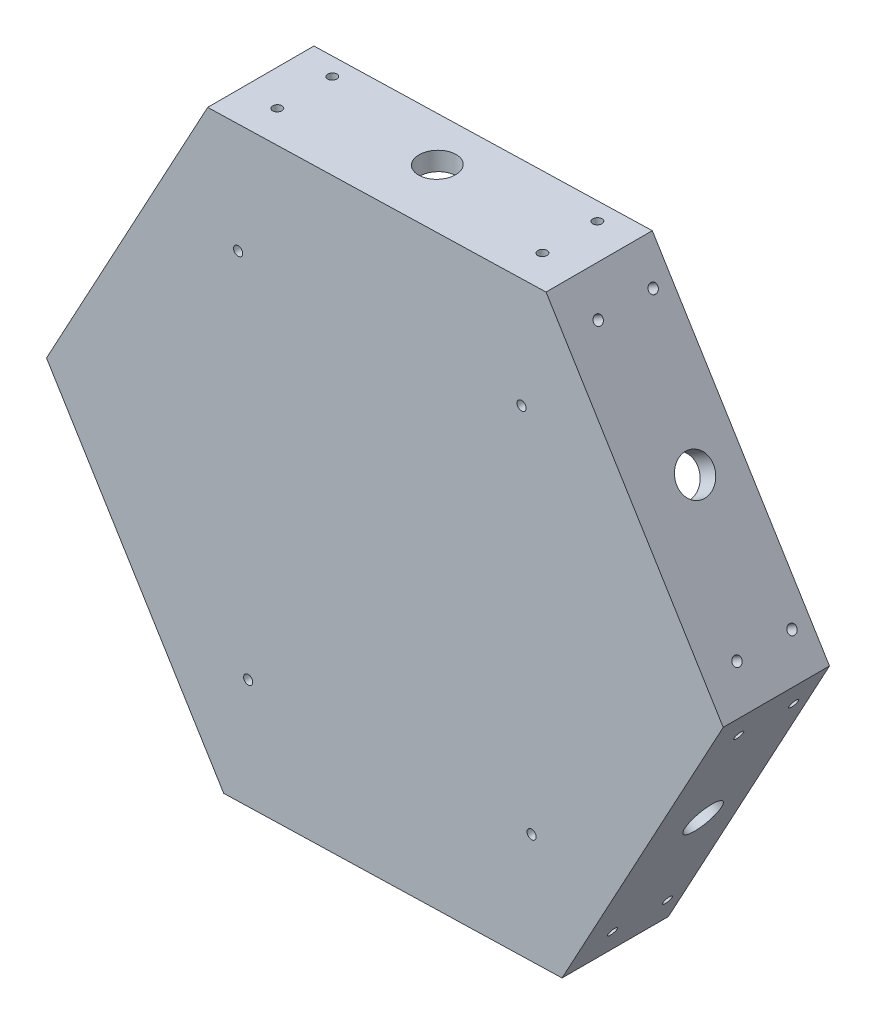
ISO-10303-21;
HEADER;
FILE_DESCRIPTION(('STEP AP214'),'2;1');
FILE_NAME('part.step','',(''),(''),'','','');
FILE_SCHEMA(('AUTOMOTIVE_DESIGN { 1 0 10303 214 1 1 1 1 }'));
ENDSEC;
DATA;
#1=APPLICATION_CONTEXT('core data for automotive mechanical design processes');
#2=APPLICATION_PROTOCOL_DEFINITION('international standard','automotive_design',2000,#1);
#3=PRODUCT_CONTEXT('',#1,'mechanical');
#4=PRODUCT('Part','Part','',(#3));
#5=PRODUCT_RELATED_PRODUCT_CATEGORY('part','',(#4));
#6=PRODUCT_DEFINITION_FORMATION('','',#4);
#7=PRODUCT_DEFINITION_CONTEXT('part definition',#1,'design');
#8=PRODUCT_DEFINITION('design','',#6,#7);
#9=PRODUCT_DEFINITION_SHAPE('','',#8);
#10=(LENGTH_UNIT() NAMED_UNIT(*) SI_UNIT(.MILLI.,.METRE.));
#11=(NAMED_UNIT(*) PLANE_ANGLE_UNIT() SI_UNIT($,.RADIAN.));
#12=(NAMED_UNIT(*) SI_UNIT($,.STERADIAN.) SOLID_ANGLE_UNIT());
#13=UNCERTAINTY_MEASURE_WITH_UNIT(LENGTH_MEASURE(1.E-05),#10,'distance_accuracy_value','');
#14=(GEOMETRIC_REPRESENTATION_CONTEXT(3) GLOBAL_UNCERTAINTY_ASSIGNED_CONTEXT((#13)) GLOBAL_UNIT_ASSIGNED_CONTEXT((#10,
#11,#12)) REPRESENTATION_CONTEXT('',''));
#15=CARTESIAN_POINT('',(0.,0.,0.));
#16=DIRECTION('',(0.,0.,1.));
#17=DIRECTION('',(1.,0.,0.));
#18=AXIS2_PLACEMENT_3D('',#15,#16,#17);
#19=CARTESIAN_POINT('',(0.,0.,0.));
#20=DIRECTION('',(0.,0.,1.));
#21=DIRECTION('',(1.,0.,0.));
#22=AXIS2_PLACEMENT_3D('',#19,#20,#21);
#23=PLANE('',#22);
#24=DIRECTION('',(0.476159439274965,0.879358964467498,0.));
#25=VECTOR('',#24,1.);
#26=CARTESIAN_POINT('',(61.4119354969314,-99.959929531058,0.));
#27=LINE('',#26,#25);
#28=CARTESIAN_POINT('',(61.4119354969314,-99.959929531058,0.));
#29=VERTEX_POINT('',#28);
#30=CARTESIAN_POINT('',(117.273806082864,3.20433147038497,0.));
#31=VERTEX_POINT('',#30);
#32=EDGE_CURVE('E247',#29,#31,#27,.T.);
#33=ORIENTED_EDGE('',*,*,#32,.F.);
#34=DIRECTION('',(0.999626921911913,0.0273133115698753,0.));
#35=VECTOR('',#34,1.);
#36=CARTESIAN_POINT('',(-55.8618705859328,-103.164261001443,0.));
#37=LINE('',#36,#35);
#38=CARTESIAN_POINT('',(-55.8618705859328,-103.164261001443,0.));
#39=VERTEX_POINT('',#38);
#40=EDGE_CURVE('E67',#39,#29,#37,.T.);
#41=ORIENTED_EDGE('',*,*,#40,.F.);
#42=DIRECTION('',(0.523467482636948,-0.852045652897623,0.));
#43=VECTOR('',#42,1.);
#44=CARTESIAN_POINT('',(-117.273806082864,-3.20433147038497,0.));
#45=LINE('',#44,#43);
#46=CARTESIAN_POINT('',(-117.273806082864,-3.20433147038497,0.));
#47=VERTEX_POINT('',#46);
#48=EDGE_CURVE('E259',#47,#39,#45,.T.);
#49=ORIENTED_EDGE('',*,*,#48,.F.);
#50=DIRECTION('',(-0.476159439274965,-0.879358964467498,0.));
#51=VECTOR('',#50,1.);
#52=CARTESIAN_POINT('',(-61.4119354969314,99.959929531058,0.));
#53=LINE('',#52,#51);
#54=CARTESIAN_POINT('',(-61.4119354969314,99.959929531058,0.));
#55=VERTEX_POINT('',#54);
#56=EDGE_CURVE('E256',#55,#47,#53,.T.);
#57=ORIENTED_EDGE('',*,*,#56,.F.);
#58=DIRECTION('',(-0.999626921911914,-0.027313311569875,0.));
#59=VECTOR('',#58,1.);
#60=CARTESIAN_POINT('',(55.8618705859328,103.164261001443,0.));
#61=LINE('',#60,#59);
#62=CARTESIAN_POINT('',(55.8618705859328,103.164261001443,0.));
#63=VERTEX_POINT('',#62);
#64=EDGE_CURVE('E253',#63,#55,#61,.T.);
#65=ORIENTED_EDGE('',*,*,#64,.F.);
#66=DIRECTION('',(-0.523467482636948,0.852045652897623,0.));
#67=VECTOR('',#66,1.);
#68=CARTESIAN_POINT('',(117.273806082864,3.20433147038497,0.));
#69=LINE('',#68,#67);
#70=EDGE_CURVE('E142',#31,#63,#69,.T.);
#71=ORIENTED_EDGE('',*,*,#70,.F.);
#72=EDGE_LOOP('',(#33,#41,#49,#57,#65,#71));
#73=FACE_BOUND('',#72,.T.);
#74=DIRECTION('',(-0.523467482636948,0.852045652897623,0.));
#75=VECTOR('',#74,1.);
#76=CARTESIAN_POINT('',(109.944193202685,3.0040607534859,0.));
#77=LINE('',#76,#75);
#78=CARTESIAN_POINT('',(109.944193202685,3.0040607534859,0.));
#79=VERTEX_POINT('',#78);
#80=CARTESIAN_POINT('',(52.370503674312,96.7164946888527,0.));
#81=VERTEX_POINT('',#80);
#82=EDGE_CURVE('E59',#79,#81,#77,.T.);
#83=ORIENTED_EDGE('',*,*,#82,.T.);
#84=DIRECTION('',(-0.999626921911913,-0.0273133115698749,0.));
#85=VECTOR('',#84,1.);
#86=CARTESIAN_POINT('',(52.370503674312,96.7164946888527,0.));
#87=LINE('',#86,#85);
#88=CARTESIAN_POINT('',(-57.5736895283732,93.7124339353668,0.));
#89=VERTEX_POINT('',#88);
#90=EDGE_CURVE('E211',#81,#89,#87,.T.);
#91=ORIENTED_EDGE('',*,*,#90,.T.);
#92=DIRECTION('',(-0.476159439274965,-0.879358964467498,0.));
#93=VECTOR('',#92,1.);
#94=CARTESIAN_POINT('',(-57.5736895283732,93.7124339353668,0.));
#95=LINE('',#94,#93);
#96=CARTESIAN_POINT('',(-109.944193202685,-3.00406075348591,0.));
#97=VERTEX_POINT('',#96);
#98=EDGE_CURVE('E215',#89,#97,#95,.T.);
#99=ORIENTED_EDGE('',*,*,#98,.T.);
#100=DIRECTION('',(0.523467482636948,-0.852045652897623,0.));
#101=VECTOR('',#100,1.);
#102=CARTESIAN_POINT('',(-109.944193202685,-3.00406075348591,0.));
#103=LINE('',#102,#101);
#104=CARTESIAN_POINT('',(-52.3705036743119,-96.7164946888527,0.));
#105=VERTEX_POINT('',#104);
#106=EDGE_CURVE('E219',#97,#105,#103,.T.);
#107=ORIENTED_EDGE('',*,*,#106,.T.);
#108=DIRECTION('',(0.999626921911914,0.027313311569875,0.));
#109=VECTOR('',#108,1.);
#110=CARTESIAN_POINT('',(-52.3705036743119,-96.7164946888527,0.));
#111=LINE('',#110,#109);
#112=CARTESIAN_POINT('',(57.5736895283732,-93.7124339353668,0.));
#113=VERTEX_POINT('',#112);
#114=EDGE_CURVE('E223',#105,#113,#111,.T.);
#115=ORIENTED_EDGE('',*,*,#114,.T.);
#116=DIRECTION('',(0.476159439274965,0.879358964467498,0.));
#117=VECTOR('',#116,1.);
#118=CARTESIAN_POINT('',(57.5736895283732,-93.7124339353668,0.));
#119=LINE('',#118,#117);
#120=EDGE_CURVE('E188',#113,#79,#119,.T.);
#121=ORIENTED_EDGE('',*,*,#120,.T.);
#122=EDGE_LOOP('',(#83,#91,#99,#107,#115,#121));
#123=FACE_BOUND('',#122,.T.);
#124=ADVANCED_FACE('F43',(#73,#123),#23,.F.);
#125=CARTESIAN_POINT('',(61.4119354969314,-99.959929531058,31.75));
#126=DIRECTION('',(-0.879358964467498,0.476159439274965,0.));
#127=DIRECTION('',(-0.476159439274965,-0.879358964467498,0.));
#128=AXIS2_PLACEMENT_3D('',#125,#126,#127);
#129=PLANE('',#128);
#130=CARTESIAN_POINT('',(111.226581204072,-7.96352737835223,25.4));
#131=DIRECTION('',(-0.879358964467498,0.476159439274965,0.));
#132=DIRECTION('',(-0.476159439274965,-0.879358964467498,0.));
#133=AXIS2_PLACEMENT_3D('',#130,#131,#132);
#134=CIRCLE('',#133,1.58749999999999);
#135=CARTESIAN_POINT('',(110.470678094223,-9.35950973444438,25.4));
#136=VERTEX_POINT('',#135);
#137=EDGE_CURVE('E370',#136,#136,#134,.T.);
#138=ORIENTED_EDGE('',*,*,#137,.T.);
#139=EDGE_LOOP('',(#138));
#140=FACE_BOUND('',#139,.T.);
#141=CARTESIAN_POINT('',(67.4591603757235,-88.7920706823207,6.35));
#142=DIRECTION('',(-0.879358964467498,0.476159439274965,0.));
#143=DIRECTION('',(-0.476159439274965,-0.879358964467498,0.));
#144=AXIS2_PLACEMENT_3D('',#141,#142,#143);
#145=CIRCLE('',#144,1.5875);
#146=CARTESIAN_POINT('',(66.7032572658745,-90.1880530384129,6.35));
#147=VERTEX_POINT('',#146);
#148=EDGE_CURVE('E364',#147,#147,#145,.T.);
#149=ORIENTED_EDGE('',*,*,#148,.T.);
#150=EDGE_LOOP('',(#149));
#151=FACE_BOUND('',#150,.T.);
#152=CARTESIAN_POINT('',(67.4591603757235,-88.7920706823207,25.4));
#153=DIRECTION('',(-0.879358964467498,0.476159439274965,0.));
#154=DIRECTION('',(-0.476159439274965,-0.879358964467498,0.));
#155=AXIS2_PLACEMENT_3D('',#152,#153,#154);
#156=CIRCLE('',#155,1.5875);
#157=CARTESIAN_POINT('',(66.7032572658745,-90.1880530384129,25.4));
#158=VERTEX_POINT('',#157);
#159=EDGE_CURVE('E359',#158,#158,#156,.T.);
#160=ORIENTED_EDGE('',*,*,#159,.T.);
#161=EDGE_LOOP('',(#160));
#162=FACE_BOUND('',#161,.T.);
#163=CARTESIAN_POINT('',(89.3428707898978,-48.3777990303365,15.875));
#164=DIRECTION('',(-0.879358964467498,0.476159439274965,0.));
#165=DIRECTION('',(-0.476159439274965,-0.879358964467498,0.));
#166=AXIS2_PLACEMENT_3D('',#163,#164,#165);
#167=CIRCLE('',#166,6.35);
#168=CARTESIAN_POINT('',(86.3192583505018,-53.9617284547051,15.875));
#169=VERTEX_POINT('',#168);
#170=EDGE_CURVE('E354',#169,#169,#167,.T.);
#171=ORIENTED_EDGE('',*,*,#170,.T.);
#172=EDGE_LOOP('',(#171));
#173=FACE_BOUND('',#172,.T.);
#174=CARTESIAN_POINT('',(111.226581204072,-7.96352737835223,6.35));
#175=DIRECTION('',(-0.879358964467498,0.476159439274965,0.));
#176=DIRECTION('',(-0.476159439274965,-0.879358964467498,0.));
#177=AXIS2_PLACEMENT_3D('',#174,#175,#176);
#178=CIRCLE('',#177,1.5875);
#179=CARTESIAN_POINT('',(110.470678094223,-9.35950973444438,6.35));
#180=VERTEX_POINT('',#179);
#181=EDGE_CURVE('E348',#180,#180,#178,.T.);
#182=ORIENTED_EDGE('',*,*,#181,.T.);
#183=EDGE_LOOP('',(#182));
#184=FACE_BOUND('',#183,.T.);
#185=ORIENTED_EDGE('',*,*,#32,.T.);
#186=DIRECTION('',(0.,0.,-1.));
#187=VECTOR('',#186,1.);
#188=CARTESIAN_POINT('',(117.273806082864,3.20433147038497,31.75));
#189=LINE('',#188,#187);
#190=CARTESIAN_POINT('',(117.273806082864,3.20433147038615,36.83));
#191=VERTEX_POINT('',#190);
#192=EDGE_CURVE('E52',#191,#31,#189,.T.);
#193=ORIENTED_EDGE('',*,*,#192,.F.);
#194=DIRECTION('',(0.476159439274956,0.879358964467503,0.));
#195=VECTOR('',#194,1.);
#196=CARTESIAN_POINT('',(61.4119354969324,-99.9599295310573,36.83));
#197=LINE('',#196,#195);
#198=CARTESIAN_POINT('',(61.4119354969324,-99.9599295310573,36.83));
#199=VERTEX_POINT('',#198);
#200=EDGE_CURVE('E162',#199,#191,#197,.T.);
#201=ORIENTED_EDGE('',*,*,#200,.F.);
#202=DIRECTION('',(0.,0.,-1.));
#203=VECTOR('',#202,1.);
#204=CARTESIAN_POINT('',(61.4119354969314,-99.959929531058,31.75));
#205=LINE('',#204,#203);
#206=EDGE_CURVE('E264',#199,#29,#205,.T.);
#207=ORIENTED_EDGE('',*,*,#206,.T.);
#208=EDGE_LOOP('',(#185,#193,#201,#207));
#209=FACE_BOUND('',#208,.T.);
#210=ADVANCED_FACE('F45',(#140,#151,#162,#173,#184,#209),#129,.F.);
#211=CARTESIAN_POINT('',(117.273806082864,3.20433147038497,31.75));
#212=DIRECTION('',(-0.852045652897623,-0.523467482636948,0.));
#213=DIRECTION('',(0.523467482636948,-0.852045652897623,0.));
#214=AXIS2_PLACEMENT_3D('',#211,#212,#213);
#215=PLANE('',#214);
#216=CARTESIAN_POINT('',(62.5099076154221,92.3432812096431,6.35));
#217=DIRECTION('',(0.852045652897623,0.523467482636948,0.));
#218=DIRECTION('',(-0.523467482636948,0.852045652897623,0.));
#219=AXIS2_PLACEMENT_3D('',#216,#217,#218);
#220=CIRCLE('',#219,1.5875);
#221=CARTESIAN_POINT('',(61.6789029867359,93.6959036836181,6.35));
#222=VERTEX_POINT('',#221);
#223=EDGE_CURVE('E393',#222,#222,#220,.T.);
#224=ORIENTED_EDGE('',*,*,#223,.F.);
#225=EDGE_LOOP('',(#224));
#226=FACE_BOUND('',#225,.T.);
#227=CARTESIAN_POINT('',(110.625769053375,14.0253112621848,25.4));
#228=DIRECTION('',(0.852045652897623,0.523467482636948,0.));
#229=DIRECTION('',(-0.523467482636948,0.852045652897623,0.));
#230=AXIS2_PLACEMENT_3D('',#227,#228,#229);
#231=CIRCLE('',#230,1.5875);
#232=CARTESIAN_POINT('',(109.794764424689,15.3779337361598,25.4));
#233=VERTEX_POINT('',#232);
#234=EDGE_CURVE('E389',#233,#233,#231,.T.);
#235=ORIENTED_EDGE('',*,*,#234,.F.);
#236=EDGE_LOOP('',(#235));
#237=FACE_BOUND('',#236,.T.);
#238=CARTESIAN_POINT('',(110.625769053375,14.0253112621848,6.34999999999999));
#239=DIRECTION('',(0.852045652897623,0.523467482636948,0.));
#240=DIRECTION('',(-0.523467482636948,0.852045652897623,0.));
#241=AXIS2_PLACEMENT_3D('',#238,#239,#240);
#242=CIRCLE('',#241,1.5875);
#243=CARTESIAN_POINT('',(109.794764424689,15.3779337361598,6.34999999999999));
#244=VERTEX_POINT('',#243);
#245=EDGE_CURVE('E385',#244,#244,#242,.T.);
#246=ORIENTED_EDGE('',*,*,#245,.F.);
#247=EDGE_LOOP('',(#246));
#248=FACE_BOUND('',#247,.T.);
#249=CARTESIAN_POINT('',(86.5678383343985,53.1842962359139,15.875));
#250=DIRECTION('',(0.852045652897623,0.523467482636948,0.));
#251=DIRECTION('',(-0.523467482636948,0.852045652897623,0.));
#252=AXIS2_PLACEMENT_3D('',#249,#250,#251);
#253=CIRCLE('',#252,6.35);
#254=CARTESIAN_POINT('',(83.2438198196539,58.5947861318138,15.875));
#255=VERTEX_POINT('',#254);
#256=EDGE_CURVE('E384',#255,#255,#253,.T.);
#257=ORIENTED_EDGE('',*,*,#256,.F.);
#258=EDGE_LOOP('',(#257));
#259=FACE_BOUND('',#258,.T.);
#260=CARTESIAN_POINT('',(62.5099076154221,92.3432812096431,25.4));
#261=DIRECTION('',(0.852045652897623,0.523467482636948,0.));
#262=DIRECTION('',(-0.523467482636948,0.852045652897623,0.));
#263=AXIS2_PLACEMENT_3D('',#260,#261,#262);
#264=CIRCLE('',#263,1.5875);
#265=CARTESIAN_POINT('',(61.6789029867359,93.6959036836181,25.4));
#266=VERTEX_POINT('',#265);
#267=EDGE_CURVE('E312',#266,#266,#264,.T.);
#268=ORIENTED_EDGE('',*,*,#267,.F.);
#269=EDGE_LOOP('',(#268));
#270=FACE_BOUND('',#269,.T.);
#271=ORIENTED_EDGE('',*,*,#70,.T.);
#272=DIRECTION('',(0.,0.,-1.));
#273=VECTOR('',#272,1.);
#274=CARTESIAN_POINT('',(55.8618705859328,103.164261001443,31.75));
#275=LINE('',#274,#273);
#276=CARTESIAN_POINT('',(55.8618705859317,103.164261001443,36.83));
#277=VERTEX_POINT('',#276);
#278=EDGE_CURVE('E136',#277,#63,#275,.T.);
#279=ORIENTED_EDGE('',*,*,#278,.F.);
#280=DIRECTION('',(-0.523467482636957,0.852045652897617,0.));
#281=VECTOR('',#280,1.);
#282=CARTESIAN_POINT('',(117.273806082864,3.20433147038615,36.83));
#283=LINE('',#282,#281);
#284=EDGE_CURVE('E141',#191,#277,#283,.T.);
#285=ORIENTED_EDGE('',*,*,#284,.F.);
#286=ORIENTED_EDGE('',*,*,#192,.T.);
#287=EDGE_LOOP('',(#271,#279,#285,#286));
#288=FACE_BOUND('',#287,.T.);
#289=ADVANCED_FACE('F138',(#226,#237,#248,#259,#270,#288),#215,.F.);
#290=CARTESIAN_POINT('',(55.8618705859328,103.164261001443,31.75));
#291=DIRECTION('',(0.027313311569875,-0.999626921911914,0.));
#292=DIRECTION('',(0.999626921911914,0.027313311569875,0.));
#293=AXIS2_PLACEMENT_3D('',#290,#291,#292);
#294=PLANE('',#293);
#295=CARTESIAN_POINT('',(-48.7166735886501,100.306808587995,6.34999999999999));
#296=DIRECTION('',(0.027313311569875,-0.999626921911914,0.));
#297=DIRECTION('',(0.999626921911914,0.027313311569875,0.));
#298=AXIS2_PLACEMENT_3D('',#295,#296,#297);
#299=CIRCLE('',#298,1.5875);
#300=CARTESIAN_POINT('',(-47.1297658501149,100.350168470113,6.34999999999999));
#301=VERTEX_POINT('',#300);
#302=EDGE_CURVE('E164',#301,#301,#299,.T.);
#303=ORIENTED_EDGE('',*,*,#302,.T.);
#304=EDGE_LOOP('',(#303));
#305=FACE_BOUND('',#304,.T.);
#306=CARTESIAN_POINT('',(43.1666086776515,102.817381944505,25.4));
#307=DIRECTION('',(0.027313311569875,-0.999626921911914,0.));
#308=DIRECTION('',(0.999626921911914,0.027313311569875,0.));
#309=AXIS2_PLACEMENT_3D('',#306,#307,#308);
#310=CIRCLE('',#309,1.58749999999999);
#311=CARTESIAN_POINT('',(44.7535164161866,102.860741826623,25.4));
#312=VERTEX_POINT('',#311);
#313=EDGE_CURVE('E306',#312,#312,#310,.T.);
#314=ORIENTED_EDGE('',*,*,#313,.T.);
#315=EDGE_LOOP('',(#314));
#316=FACE_BOUND('',#315,.T.);
#317=CARTESIAN_POINT('',(43.1666086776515,102.817381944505,6.35));
#318=DIRECTION('',(0.027313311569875,-0.999626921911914,0.));
#319=DIRECTION('',(0.999626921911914,0.027313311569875,0.));
#320=AXIS2_PLACEMENT_3D('',#317,#318,#319);
#321=CIRCLE('',#320,1.58749999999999);
#322=CARTESIAN_POINT('',(44.7535164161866,102.860741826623,6.35));
#323=VERTEX_POINT('',#322);
#324=EDGE_CURVE('E301',#323,#323,#321,.T.);
#325=ORIENTED_EDGE('',*,*,#324,.T.);
#326=EDGE_LOOP('',(#325));
#327=FACE_BOUND('',#326,.T.);
#328=CARTESIAN_POINT('',(-2.7750324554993,101.56209526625,15.875));
#329=DIRECTION('',(0.027313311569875,-0.999626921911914,0.));
#330=DIRECTION('',(0.999626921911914,0.027313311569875,0.));
#331=AXIS2_PLACEMENT_3D('',#328,#329,#330);
#332=CIRCLE('',#331,6.35);
#333=CARTESIAN_POINT('',(3.57259849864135,101.735534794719,15.875));
#334=VERTEX_POINT('',#333);
#335=EDGE_CURVE('E295',#334,#334,#332,.T.);
#336=ORIENTED_EDGE('',*,*,#335,.T.);
#337=EDGE_LOOP('',(#336));
#338=FACE_BOUND('',#337,.T.);
#339=CARTESIAN_POINT('',(-48.7166735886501,100.306808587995,25.4));
#340=DIRECTION('',(0.027313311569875,-0.999626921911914,0.));
#341=DIRECTION('',(0.999626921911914,0.027313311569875,0.));
#342=AXIS2_PLACEMENT_3D('',#339,#340,#341);
#343=CIRCLE('',#342,1.5875);
#344=CARTESIAN_POINT('',(-47.1297658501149,100.350168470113,25.4));
#345=VERTEX_POINT('',#344);
#346=EDGE_CURVE('E289',#345,#345,#343,.T.);
#347=ORIENTED_EDGE('',*,*,#346,.T.);
#348=EDGE_LOOP('',(#347));
#349=FACE_BOUND('',#348,.T.);
#350=ORIENTED_EDGE('',*,*,#64,.T.);
#351=DIRECTION('',(0.,0.,-1.));
#352=VECTOR('',#351,1.);
#353=CARTESIAN_POINT('',(-61.4119354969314,99.959929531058,31.75));
#354=LINE('',#353,#352);
#355=CARTESIAN_POINT('',(-61.4119354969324,99.9599295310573,36.83));
#356=VERTEX_POINT('',#355);
#357=EDGE_CURVE('E146',#356,#55,#354,.T.);
#358=ORIENTED_EDGE('',*,*,#357,.F.);
#359=DIRECTION('',(-0.999626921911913,-0.0273133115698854,0.));
#360=VECTOR('',#359,1.);
#361=CARTESIAN_POINT('',(55.8618705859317,103.164261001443,36.83));
#362=LINE('',#361,#360);
#363=EDGE_CURVE('E149',#277,#356,#362,.T.);
#364=ORIENTED_EDGE('',*,*,#363,.F.);
#365=ORIENTED_EDGE('',*,*,#278,.T.);
#366=EDGE_LOOP('',(#350,#358,#364,#365));
#367=FACE_BOUND('',#366,.T.);
#368=ADVANCED_FACE('F150',(#305,#316,#327,#338,#349,#367),#294,.F.);
#369=CARTESIAN_POINT('',(-61.4119354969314,99.959929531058,31.75));
#370=DIRECTION('',(0.879358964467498,-0.476159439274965,0.));
#371=DIRECTION('',(0.476159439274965,0.879358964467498,0.));
#372=AXIS2_PLACEMENT_3D('',#369,#370,#371);
#373=PLANE('',#372);
#374=CARTESIAN_POINT('',(-67.4591603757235,88.7920706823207,25.4));
#375=DIRECTION('',(-0.879358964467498,0.476159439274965,0.));
#376=DIRECTION('',(-0.476159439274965,-0.879358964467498,0.));
#377=AXIS2_PLACEMENT_3D('',#374,#375,#376);
#378=CIRCLE('',#377,1.58749999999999);
#379=CARTESIAN_POINT('',(-68.2150634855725,87.3960883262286,25.4));
#380=VERTEX_POINT('',#379);
#381=EDGE_CURVE('E701',#380,#380,#378,.T.);
#382=ORIENTED_EDGE('',*,*,#381,.F.);
#383=EDGE_LOOP('',(#382));
#384=FACE_BOUND('',#383,.T.);
#385=CARTESIAN_POINT('',(-111.226581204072,7.96352737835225,6.35));
#386=DIRECTION('',(-0.879358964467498,0.476159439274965,0.));
#387=DIRECTION('',(-0.476159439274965,-0.879358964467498,0.));
#388=AXIS2_PLACEMENT_3D('',#385,#386,#387);
#389=CIRCLE('',#388,1.5875);
#390=CARTESIAN_POINT('',(-111.982484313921,6.5675450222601,6.35));
#391=VERTEX_POINT('',#390);
#392=EDGE_CURVE('E696',#391,#391,#389,.T.);
#393=ORIENTED_EDGE('',*,*,#392,.F.);
#394=EDGE_LOOP('',(#393));
#395=FACE_BOUND('',#394,.T.);
#396=CARTESIAN_POINT('',(-111.226581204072,7.96352737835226,25.4));
#397=DIRECTION('',(-0.879358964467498,0.476159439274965,0.));
#398=DIRECTION('',(-0.476159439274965,-0.879358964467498,0.));
#399=AXIS2_PLACEMENT_3D('',#396,#397,#398);
#400=CIRCLE('',#399,1.5875);
#401=CARTESIAN_POINT('',(-111.982484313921,6.56754502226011,25.4));
#402=VERTEX_POINT('',#401);
#403=EDGE_CURVE('E692',#402,#402,#400,.T.);
#404=ORIENTED_EDGE('',*,*,#403,.F.);
#405=EDGE_LOOP('',(#404));
#406=FACE_BOUND('',#405,.T.);
#407=CARTESIAN_POINT('',(-89.3428707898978,48.3777990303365,15.875));
#408=DIRECTION('',(-0.879358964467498,0.476159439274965,0.));
#409=DIRECTION('',(-0.476159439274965,-0.879358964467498,0.));
#410=AXIS2_PLACEMENT_3D('',#407,#408,#409);
#411=CIRCLE('',#410,6.35);
#412=CARTESIAN_POINT('',(-92.3664832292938,42.7938696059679,15.875));
#413=VERTEX_POINT('',#412);
#414=EDGE_CURVE('E697',#413,#413,#411,.T.);
#415=ORIENTED_EDGE('',*,*,#414,.F.);
#416=EDGE_LOOP('',(#415));
#417=FACE_BOUND('',#416,.T.);
#418=CARTESIAN_POINT('',(-67.4591603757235,88.7920706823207,6.35));
#419=DIRECTION('',(-0.879358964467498,0.476159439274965,0.));
#420=DIRECTION('',(-0.476159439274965,-0.879358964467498,0.));
#421=AXIS2_PLACEMENT_3D('',#418,#419,#420);
#422=CIRCLE('',#421,1.5875);
#423=CARTESIAN_POINT('',(-68.2150634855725,87.3960883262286,6.35));
#424=VERTEX_POINT('',#423);
#425=EDGE_CURVE('E342',#424,#424,#422,.T.);
#426=ORIENTED_EDGE('',*,*,#425,.F.);
#427=EDGE_LOOP('',(#426));
#428=FACE_BOUND('',#427,.T.);
#429=ORIENTED_EDGE('',*,*,#56,.T.);
#430=DIRECTION('',(0.,0.,-1.));
#431=VECTOR('',#430,1.);
#432=CARTESIAN_POINT('',(-117.273806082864,-3.20433147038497,31.75));
#433=LINE('',#432,#431);
#434=CARTESIAN_POINT('',(-117.273806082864,-3.20433147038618,36.83));
#435=VERTEX_POINT('',#434);
#436=EDGE_CURVE('E270',#435,#47,#433,.T.);
#437=ORIENTED_EDGE('',*,*,#436,.F.);
#438=DIRECTION('',(-0.476159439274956,-0.879358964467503,0.));
#439=VECTOR('',#438,1.);
#440=CARTESIAN_POINT('',(-61.4119354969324,99.9599295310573,36.83));
#441=LINE('',#440,#439);
#442=EDGE_CURVE('E156',#356,#435,#441,.T.);
#443=ORIENTED_EDGE('',*,*,#442,.F.);
#444=ORIENTED_EDGE('',*,*,#357,.T.);
#445=EDGE_LOOP('',(#429,#437,#443,#444));
#446=FACE_BOUND('',#445,.T.);
#447=ADVANCED_FACE('F546',(#384,#395,#406,#417,#428,#446),#373,.F.);
#448=CARTESIAN_POINT('',(-117.273806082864,-3.20433147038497,31.75));
#449=DIRECTION('',(0.852045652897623,0.523467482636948,0.));
#450=DIRECTION('',(-0.523467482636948,0.852045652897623,0.));
#451=AXIS2_PLACEMENT_3D('',#448,#449,#450);
#452=PLANE('',#451);
#453=CARTESIAN_POINT('',(-110.625769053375,-14.0253112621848,6.35));
#454=DIRECTION('',(0.852045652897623,0.523467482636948,0.));
#455=DIRECTION('',(-0.523467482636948,0.852045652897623,0.));
#456=AXIS2_PLACEMENT_3D('',#453,#454,#455);
#457=CIRCLE('',#456,1.5875);
#458=CARTESIAN_POINT('',(-111.456773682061,-12.6726887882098,6.35));
#459=VERTEX_POINT('',#458);
#460=EDGE_CURVE('E430',#459,#459,#457,.T.);
#461=ORIENTED_EDGE('',*,*,#460,.T.);
#462=EDGE_LOOP('',(#461));
#463=FACE_BOUND('',#462,.T.);
#464=CARTESIAN_POINT('',(-62.509907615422,-92.3432812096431,25.4));
#465=DIRECTION('',(0.852045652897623,0.523467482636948,0.));
#466=DIRECTION('',(-0.523467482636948,0.852045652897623,0.));
#467=AXIS2_PLACEMENT_3D('',#464,#465,#466);
#468=CIRCLE('',#467,1.5875);
#469=CARTESIAN_POINT('',(-63.3409122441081,-90.9906587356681,25.4));
#470=VERTEX_POINT('',#469);
#471=EDGE_CURVE('E336',#470,#470,#468,.T.);
#472=ORIENTED_EDGE('',*,*,#471,.T.);
#473=EDGE_LOOP('',(#472));
#474=FACE_BOUND('',#473,.T.);
#475=CARTESIAN_POINT('',(-62.509907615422,-92.3432812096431,6.34999999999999));
#476=DIRECTION('',(0.852045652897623,0.523467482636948,0.));
#477=DIRECTION('',(-0.523467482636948,0.852045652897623,0.));
#478=AXIS2_PLACEMENT_3D('',#475,#476,#477);
#479=CIRCLE('',#478,1.5875);
#480=CARTESIAN_POINT('',(-63.3409122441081,-90.9906587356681,6.34999999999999));
#481=VERTEX_POINT('',#480);
#482=EDGE_CURVE('E330',#481,#481,#479,.T.);
#483=ORIENTED_EDGE('',*,*,#482,.T.);
#484=EDGE_LOOP('',(#483));
#485=FACE_BOUND('',#484,.T.);
#486=CARTESIAN_POINT('',(-86.5678383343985,-53.1842962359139,15.875));
#487=DIRECTION('',(0.852045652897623,0.523467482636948,0.));
#488=DIRECTION('',(-0.523467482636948,0.852045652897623,0.));
#489=AXIS2_PLACEMENT_3D('',#486,#487,#488);
#490=CIRCLE('',#489,6.35);
#491=CARTESIAN_POINT('',(-89.8918568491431,-47.773806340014,15.875));
#492=VERTEX_POINT('',#491);
#493=EDGE_CURVE('E324',#492,#492,#490,.T.);
#494=ORIENTED_EDGE('',*,*,#493,.T.);
#495=EDGE_LOOP('',(#494));
#496=FACE_BOUND('',#495,.T.);
#497=CARTESIAN_POINT('',(-110.625769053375,-14.0253112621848,25.4));
#498=DIRECTION('',(0.852045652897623,0.523467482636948,0.));
#499=DIRECTION('',(-0.523467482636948,0.852045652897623,0.));
#500=AXIS2_PLACEMENT_3D('',#497,#498,#499);
#501=CIRCLE('',#500,1.5875);
#502=CARTESIAN_POINT('',(-111.456773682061,-12.6726887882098,25.4));
#503=VERTEX_POINT('',#502);
#504=EDGE_CURVE('E318',#503,#503,#501,.T.);
#505=ORIENTED_EDGE('',*,*,#504,.T.);
#506=EDGE_LOOP('',(#505));
#507=FACE_BOUND('',#506,.T.);
#508=ORIENTED_EDGE('',*,*,#48,.T.);
#509=DIRECTION('',(0.,0.,-1.));
#510=VECTOR('',#509,1.);
#511=CARTESIAN_POINT('',(-55.8618705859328,-103.164261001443,31.75));
#512=LINE('',#511,#510);
#513=CARTESIAN_POINT('',(-55.8618705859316,-103.164261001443,36.83));
#514=VERTEX_POINT('',#513);
#515=EDGE_CURVE('E267',#514,#39,#512,.T.);
#516=ORIENTED_EDGE('',*,*,#515,.F.);
#517=DIRECTION('',(0.523467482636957,-0.852045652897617,0.));
#518=VECTOR('',#517,1.);
#519=CARTESIAN_POINT('',(-117.273806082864,-3.20433147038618,36.83));
#520=LINE('',#519,#518);
#521=EDGE_CURVE('E174',#435,#514,#520,.T.);
#522=ORIENTED_EDGE('',*,*,#521,.F.);
#523=ORIENTED_EDGE('',*,*,#436,.T.);
#524=EDGE_LOOP('',(#508,#516,#522,#523));
#525=FACE_BOUND('',#524,.T.);
#526=ADVANCED_FACE('F542',(#463,#474,#485,#496,#507,#525),#452,.F.);
#527=CARTESIAN_POINT('',(-55.8618705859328,-103.164261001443,31.75));
#528=DIRECTION('',(-0.0273133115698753,0.999626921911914,0.));
#529=DIRECTION('',(-0.999626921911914,-0.0273133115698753,0.));
#530=AXIS2_PLACEMENT_3D('',#527,#528,#529);
#531=PLANE('',#530);
#532=CARTESIAN_POINT('',(-43.1666086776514,-102.817381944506,6.34999999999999));
#533=DIRECTION('',(0.0273133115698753,-0.999626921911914,0.));
#534=DIRECTION('',(0.999626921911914,0.0273133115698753,0.));
#535=AXIS2_PLACEMENT_3D('',#532,#533,#534);
#536=CIRCLE('',#535,1.5875);
#537=CARTESIAN_POINT('',(-41.5797009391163,-102.774022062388,6.34999999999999));
#538=VERTEX_POINT('',#537);
#539=EDGE_CURVE('E443',#538,#538,#536,.T.);
#540=ORIENTED_EDGE('',*,*,#539,.F.);
#541=EDGE_LOOP('',(#540));
#542=FACE_BOUND('',#541,.T.);
#543=CARTESIAN_POINT('',(48.7166735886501,-100.306808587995,25.4));
#544=DIRECTION('',(0.0273133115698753,-0.999626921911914,0.));
#545=DIRECTION('',(0.999626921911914,0.0273133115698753,0.));
#546=AXIS2_PLACEMENT_3D('',#543,#544,#545);
#547=CIRCLE('',#546,1.58749999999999);
#548=CARTESIAN_POINT('',(50.3035813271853,-100.263448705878,25.4));
#549=VERTEX_POINT('',#548);
#550=EDGE_CURVE('E439',#549,#549,#547,.T.);
#551=ORIENTED_EDGE('',*,*,#550,.F.);
#552=EDGE_LOOP('',(#551));
#553=FACE_BOUND('',#552,.T.);
#554=CARTESIAN_POINT('',(48.7166735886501,-100.306808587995,6.35));
#555=DIRECTION('',(0.0273133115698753,-0.999626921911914,0.));
#556=DIRECTION('',(0.999626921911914,0.0273133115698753,0.));
#557=AXIS2_PLACEMENT_3D('',#554,#555,#556);
#558=CIRCLE('',#557,1.58749999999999);
#559=CARTESIAN_POINT('',(50.3035813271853,-100.263448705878,6.35));
#560=VERTEX_POINT('',#559);
#561=EDGE_CURVE('E435',#560,#560,#558,.T.);
#562=ORIENTED_EDGE('',*,*,#561,.F.);
#563=EDGE_LOOP('',(#562));
#564=FACE_BOUND('',#563,.T.);
#565=CARTESIAN_POINT('',(2.77503245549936,-101.56209526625,15.875));
#566=DIRECTION('',(0.0273133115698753,-0.999626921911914,0.));
#567=DIRECTION('',(0.999626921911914,0.0273133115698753,0.));
#568=AXIS2_PLACEMENT_3D('',#565,#566,#567);
#569=CIRCLE('',#568,6.35);
#570=CARTESIAN_POINT('',(9.12266340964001,-101.388655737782,15.875));
#571=VERTEX_POINT('',#570);
#572=EDGE_CURVE('E434',#571,#571,#569,.T.);
#573=ORIENTED_EDGE('',*,*,#572,.F.);
#574=EDGE_LOOP('',(#573));
#575=FACE_BOUND('',#574,.T.);
#576=CARTESIAN_POINT('',(-43.1666086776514,-102.817381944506,25.4));
#577=DIRECTION('',(0.0273133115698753,-0.999626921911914,0.));
#578=DIRECTION('',(0.999626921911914,0.0273133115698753,0.));
#579=AXIS2_PLACEMENT_3D('',#576,#577,#578);
#580=CIRCLE('',#579,1.5875);
#581=CARTESIAN_POINT('',(-41.5797009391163,-102.774022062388,25.4));
#582=VERTEX_POINT('',#581);
#583=EDGE_CURVE('E283',#582,#582,#580,.T.);
#584=ORIENTED_EDGE('',*,*,#583,.F.);
#585=EDGE_LOOP('',(#584));
#586=FACE_BOUND('',#585,.T.);
#587=ORIENTED_EDGE('',*,*,#40,.T.);
#588=ORIENTED_EDGE('',*,*,#206,.F.);
#589=DIRECTION('',(0.999626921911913,0.0273133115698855,0.));
#590=VECTOR('',#589,1.);
#591=CARTESIAN_POINT('',(-55.8618705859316,-103.164261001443,36.83));
#592=LINE('',#591,#590);
#593=EDGE_CURVE('E178',#514,#199,#592,.T.);
#594=ORIENTED_EDGE('',*,*,#593,.F.);
#595=ORIENTED_EDGE('',*,*,#515,.T.);
#596=EDGE_LOOP('',(#587,#588,#594,#595));
#597=FACE_BOUND('',#596,.T.);
#598=ADVANCED_FACE('F539',(#542,#553,#564,#575,#586,#597),#531,.F.);
#599=CARTESIAN_POINT('',(109.944193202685,3.0040607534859,31.75));
#600=DIRECTION('',(-0.852045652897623,-0.523467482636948,0.));
#601=DIRECTION('',(0.523467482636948,-0.852045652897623,0.));
#602=AXIS2_PLACEMENT_3D('',#599,#600,#601);
#603=PLANE('',#602);
#604=CARTESIAN_POINT('',(57.0994177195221,89.0192626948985,6.35));
#605=DIRECTION('',(-0.852045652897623,-0.523467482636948,0.));
#606=DIRECTION('',(0.523467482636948,-0.852045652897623,0.));
#607=AXIS2_PLACEMENT_3D('',#604,#605,#606);
#608=CIRCLE('',#607,1.5875);
#609=CARTESIAN_POINT('',(56.268413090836,90.3718851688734,6.35));
#610=VERTEX_POINT('',#609);
#611=EDGE_CURVE('E335',#610,#610,#608,.T.);
#612=ORIENTED_EDGE('',*,*,#611,.F.);
#613=EDGE_LOOP('',(#612));
#614=FACE_BOUND('',#613,.T.);
#615=CARTESIAN_POINT('',(105.215279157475,10.7012927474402,25.4));
#616=DIRECTION('',(-0.852045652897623,-0.523467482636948,0.));
#617=DIRECTION('',(0.523467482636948,-0.852045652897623,0.));
#618=AXIS2_PLACEMENT_3D('',#615,#616,#617);
#619=CIRCLE('',#618,1.5875);
#620=CARTESIAN_POINT('',(104.384274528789,12.0539152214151,25.4));
#621=VERTEX_POINT('',#620);
#622=EDGE_CURVE('E329',#621,#621,#619,.T.);
#623=ORIENTED_EDGE('',*,*,#622,.F.);
#624=EDGE_LOOP('',(#623));
#625=FACE_BOUND('',#624,.T.);
#626=CARTESIAN_POINT('',(105.215279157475,10.7012927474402,6.34999999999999));
#627=DIRECTION('',(-0.852045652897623,-0.523467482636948,0.));
#628=DIRECTION('',(0.523467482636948,-0.852045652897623,0.));
#629=AXIS2_PLACEMENT_3D('',#626,#627,#628);
#630=CIRCLE('',#629,1.5875);
#631=CARTESIAN_POINT('',(104.384274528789,12.0539152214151,6.34999999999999));
#632=VERTEX_POINT('',#631);
#633=EDGE_CURVE('E323',#632,#632,#630,.T.);
#634=ORIENTED_EDGE('',*,*,#633,.F.);
#635=EDGE_LOOP('',(#634));
#636=FACE_BOUND('',#635,.T.);
#637=CARTESIAN_POINT('',(81.1573484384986,49.8602777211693,15.875));
#638=DIRECTION('',(-0.852045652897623,-0.523467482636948,0.));
#639=DIRECTION('',(0.523467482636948,-0.852045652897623,0.));
#640=AXIS2_PLACEMENT_3D('',#637,#638,#639);
#641=CIRCLE('',#640,6.35);
#642=CARTESIAN_POINT('',(77.833329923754,55.2707676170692,15.875));
#643=VERTEX_POINT('',#642);
#644=EDGE_CURVE('E317',#643,#643,#641,.T.);
#645=ORIENTED_EDGE('',*,*,#644,.F.);
#646=EDGE_LOOP('',(#645));
#647=FACE_BOUND('',#646,.T.);
#648=CARTESIAN_POINT('',(57.0994177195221,89.0192626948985,25.4));
#649=DIRECTION('',(-0.852045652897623,-0.523467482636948,0.));
#650=DIRECTION('',(0.523467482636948,-0.852045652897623,0.));
#651=AXIS2_PLACEMENT_3D('',#648,#649,#650);
#652=CIRCLE('',#651,1.5875);
#653=CARTESIAN_POINT('',(56.268413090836,90.3718851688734,25.4));
#654=VERTEX_POINT('',#653);
#655=EDGE_CURVE('E311',#654,#654,#652,.T.);
#656=ORIENTED_EDGE('',*,*,#655,.F.);
#657=EDGE_LOOP('',(#656));
#658=FACE_BOUND('',#657,.T.);
#659=ORIENTED_EDGE('',*,*,#82,.F.);
#660=DIRECTION('',(0.,0.,-1.));
#661=VECTOR('',#660,1.);
#662=CARTESIAN_POINT('',(109.944193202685,3.0040607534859,31.75));
#663=LINE('',#662,#661);
#664=CARTESIAN_POINT('',(109.944193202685,3.0040607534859,31.75));
#665=VERTEX_POINT('',#664);
#666=EDGE_CURVE('E208',#665,#79,#663,.T.);
#667=ORIENTED_EDGE('',*,*,#666,.F.);
#668=DIRECTION('',(-0.523467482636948,0.852045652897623,0.));
#669=VECTOR('',#668,1.);
#670=CARTESIAN_POINT('',(109.944193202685,3.0040607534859,31.75));
#671=LINE('',#670,#669);
#672=CARTESIAN_POINT('',(52.370503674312,96.7164946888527,31.75));
#673=VERTEX_POINT('',#672);
#674=EDGE_CURVE('E183',#665,#673,#671,.T.);
#675=ORIENTED_EDGE('',*,*,#674,.T.);
#676=DIRECTION('',(0.,0.,-1.));
#677=VECTOR('',#676,1.);
#678=CARTESIAN_POINT('',(52.370503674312,96.7164946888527,31.75));
#679=LINE('',#678,#677);
#680=EDGE_CURVE('E244',#673,#81,#679,.T.);
#681=ORIENTED_EDGE('',*,*,#680,.T.);
#682=EDGE_LOOP('',(#659,#667,#675,#681));
#683=FACE_BOUND('',#682,.T.);
#684=ADVANCED_FACE('F487',(#614,#625,#636,#647,#658,#683),#603,.T.);
#685=CARTESIAN_POINT('',(52.370503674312,96.7164946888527,31.75));
#686=DIRECTION('',(0.0273133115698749,-0.999626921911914,0.));
#687=DIRECTION('',(0.999626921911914,0.0273133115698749,0.));
#688=AXIS2_PLACEMENT_3D('',#685,#686,#687);
#689=PLANE('',#688);
#690=CARTESIAN_POINT('',(-48.5432340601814,93.9591776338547,6.34999999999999));
#691=DIRECTION('',(0.0273133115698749,-0.999626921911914,0.));
#692=DIRECTION('',(0.999626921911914,0.0273133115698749,0.));
#693=AXIS2_PLACEMENT_3D('',#690,#691,#692);
#694=CIRCLE('',#693,1.5875);
#695=CARTESIAN_POINT('',(-46.9563263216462,94.0025375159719,6.34999999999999));
#696=VERTEX_POINT('',#695);
#697=EDGE_CURVE('E168',#696,#696,#694,.T.);
#698=ORIENTED_EDGE('',*,*,#697,.F.);
#699=EDGE_LOOP('',(#698));
#700=FACE_BOUND('',#699,.T.);
#701=CARTESIAN_POINT('',(43.3400482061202,96.4697509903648,25.4));
#702=DIRECTION('',(0.0273133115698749,-0.999626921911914,0.));
#703=DIRECTION('',(0.999626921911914,0.0273133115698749,0.));
#704=AXIS2_PLACEMENT_3D('',#701,#702,#703);
#705=CIRCLE('',#704,1.58749999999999);
#706=CARTESIAN_POINT('',(44.9269559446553,96.513110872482,25.4));
#707=VERTEX_POINT('',#706);
#708=EDGE_CURVE('E300',#707,#707,#705,.T.);
#709=ORIENTED_EDGE('',*,*,#708,.F.);
#710=EDGE_LOOP('',(#709));
#711=FACE_BOUND('',#710,.T.);
#712=CARTESIAN_POINT('',(43.3400482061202,96.4697509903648,6.35));
#713=DIRECTION('',(0.0273133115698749,-0.999626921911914,0.));
#714=DIRECTION('',(0.999626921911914,0.0273133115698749,0.));
#715=AXIS2_PLACEMENT_3D('',#712,#713,#714);
#716=CIRCLE('',#715,1.58749999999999);
#717=CARTESIAN_POINT('',(44.9269559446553,96.513110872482,6.35));
#718=VERTEX_POINT('',#717);
#719=EDGE_CURVE('E294',#718,#718,#716,.T.);
#720=ORIENTED_EDGE('',*,*,#719,.F.);
#721=EDGE_LOOP('',(#720));
#722=FACE_BOUND('',#721,.T.);
#723=CARTESIAN_POINT('',(-2.60159292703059,95.2144643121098,15.875));
#724=DIRECTION('',(0.0273133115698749,-0.999626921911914,0.));
#725=DIRECTION('',(0.999626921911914,0.0273133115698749,0.));
#726=AXIS2_PLACEMENT_3D('',#723,#724,#725);
#727=CIRCLE('',#726,6.35);
#728=CARTESIAN_POINT('',(3.74603802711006,95.3879038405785,15.875));
#729=VERTEX_POINT('',#728);
#730=EDGE_CURVE('E288',#729,#729,#727,.T.);
#731=ORIENTED_EDGE('',*,*,#730,.F.);
#732=EDGE_LOOP('',(#731));
#733=FACE_BOUND('',#732,.T.);
#734=CARTESIAN_POINT('',(-48.5432340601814,93.9591776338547,25.4));
#735=DIRECTION('',(0.0273133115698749,-0.999626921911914,0.));
#736=DIRECTION('',(0.999626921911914,0.0273133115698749,0.));
#737=AXIS2_PLACEMENT_3D('',#734,#735,#736);
#738=CIRCLE('',#737,1.5875);
#739=CARTESIAN_POINT('',(-46.9563263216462,94.0025375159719,25.4));
#740=VERTEX_POINT('',#739);
#741=EDGE_CURVE('E282',#740,#740,#738,.T.);
#742=ORIENTED_EDGE('',*,*,#741,.F.);
#743=EDGE_LOOP('',(#742));
#744=FACE_BOUND('',#743,.T.);
#745=ORIENTED_EDGE('',*,*,#90,.F.);
#746=ORIENTED_EDGE('',*,*,#680,.F.);
#747=DIRECTION('',(-0.999626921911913,-0.0273133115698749,0.));
#748=VECTOR('',#747,1.);
#749=CARTESIAN_POINT('',(52.370503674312,96.7164946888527,31.75));
#750=LINE('',#749,#748);
#751=CARTESIAN_POINT('',(-57.5736895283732,93.7124339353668,31.75));
#752=VERTEX_POINT('',#751);
#753=EDGE_CURVE('E187',#673,#752,#750,.T.);
#754=ORIENTED_EDGE('',*,*,#753,.T.);
#755=DIRECTION('',(0.,0.,-1.));
#756=VECTOR('',#755,1.);
#757=CARTESIAN_POINT('',(-57.5736895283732,93.7124339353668,31.75));
#758=LINE('',#757,#756);
#759=EDGE_CURVE('E241',#752,#89,#758,.T.);
#760=ORIENTED_EDGE('',*,*,#759,.T.);
#761=EDGE_LOOP('',(#745,#746,#754,#760));
#762=FACE_BOUND('',#761,.T.);
#763=ADVANCED_FACE('F483',(#700,#711,#722,#733,#744,#762),#689,.T.);
#764=CARTESIAN_POINT('',(-57.5736895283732,93.7124339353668,31.75));
#765=DIRECTION('',(0.879358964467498,-0.476159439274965,0.));
#766=DIRECTION('',(0.476159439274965,0.879358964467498,0.));
#767=AXIS2_PLACEMENT_3D('',#764,#765,#766);
#768=PLANE('',#767);
#769=CARTESIAN_POINT('',(-61.8752309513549,85.7684582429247,25.4));
#770=DIRECTION('',(0.879358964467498,-0.476159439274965,0.));
#771=DIRECTION('',(0.476159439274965,0.879358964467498,0.));
#772=AXIS2_PLACEMENT_3D('',#769,#770,#771);
#773=CIRCLE('',#772,1.58749999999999);
#774=CARTESIAN_POINT('',(-61.1193278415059,87.1644405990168,25.4));
#775=VERTEX_POINT('',#774);
#776=EDGE_CURVE('E363',#775,#775,#773,.T.);
#777=ORIENTED_EDGE('',*,*,#776,.F.);
#778=EDGE_LOOP('',(#777));
#779=FACE_BOUND('',#778,.T.);
#780=CARTESIAN_POINT('',(-105.642651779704,4.93991493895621,6.35));
#781=DIRECTION('',(0.879358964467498,-0.476159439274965,0.));
#782=DIRECTION('',(0.476159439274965,0.879358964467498,0.));
#783=AXIS2_PLACEMENT_3D('',#780,#781,#782);
#784=CIRCLE('',#783,1.5875);
#785=CARTESIAN_POINT('',(-104.886748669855,6.33589729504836,6.35));
#786=VERTEX_POINT('',#785);
#787=EDGE_CURVE('E358',#786,#786,#784,.T.);
#788=ORIENTED_EDGE('',*,*,#787,.F.);
#789=EDGE_LOOP('',(#788));
#790=FACE_BOUND('',#789,.T.);
#791=CARTESIAN_POINT('',(-105.642651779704,4.93991493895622,25.4));
#792=DIRECTION('',(0.879358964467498,-0.476159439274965,0.));
#793=DIRECTION('',(0.476159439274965,0.879358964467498,0.));
#794=AXIS2_PLACEMENT_3D('',#791,#792,#793);
#795=CIRCLE('',#794,1.5875);
#796=CARTESIAN_POINT('',(-104.886748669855,6.33589729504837,25.4));
#797=VERTEX_POINT('',#796);
#798=EDGE_CURVE('E353',#797,#797,#795,.T.);
#799=ORIENTED_EDGE('',*,*,#798,.F.);
#800=EDGE_LOOP('',(#799));
#801=FACE_BOUND('',#800,.T.);
#802=CARTESIAN_POINT('',(-83.7589413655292,45.3541865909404,15.875));
#803=DIRECTION('',(0.879358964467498,-0.476159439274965,0.));
#804=DIRECTION('',(0.476159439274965,0.879358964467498,0.));
#805=AXIS2_PLACEMENT_3D('',#802,#803,#804);
#806=CIRCLE('',#805,6.35);
#807=CARTESIAN_POINT('',(-80.7353289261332,50.9381160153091,15.875));
#808=VERTEX_POINT('',#807);
#809=EDGE_CURVE('E347',#808,#808,#806,.T.);
#810=ORIENTED_EDGE('',*,*,#809,.F.);
#811=EDGE_LOOP('',(#810));
#812=FACE_BOUND('',#811,.T.);
#813=CARTESIAN_POINT('',(-61.8752309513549,85.7684582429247,6.35));
#814=DIRECTION('',(0.879358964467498,-0.476159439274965,0.));
#815=DIRECTION('',(0.476159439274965,0.879358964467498,0.));
#816=AXIS2_PLACEMENT_3D('',#813,#814,#815);
#817=CIRCLE('',#816,1.5875);
#818=CARTESIAN_POINT('',(-61.1193278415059,87.1644405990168,6.35));
#819=VERTEX_POINT('',#818);
#820=EDGE_CURVE('E341',#819,#819,#817,.T.);
#821=ORIENTED_EDGE('',*,*,#820,.F.);
#822=EDGE_LOOP('',(#821));
#823=FACE_BOUND('',#822,.T.);
#824=ORIENTED_EDGE('',*,*,#98,.F.);
#825=ORIENTED_EDGE('',*,*,#759,.F.);
#826=DIRECTION('',(-0.476159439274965,-0.879358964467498,0.));
#827=VECTOR('',#826,1.);
#828=CARTESIAN_POINT('',(-57.5736895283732,93.7124339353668,31.75));
#829=LINE('',#828,#827);
#830=CARTESIAN_POINT('',(-109.944193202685,-3.00406075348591,31.75));
#831=VERTEX_POINT('',#830);
#832=EDGE_CURVE('E192',#752,#831,#829,.T.);
#833=ORIENTED_EDGE('',*,*,#832,.T.);
#834=DIRECTION('',(0.,0.,-1.));
#835=VECTOR('',#834,1.);
#836=CARTESIAN_POINT('',(-109.944193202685,-3.00406075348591,31.75));
#837=LINE('',#836,#835);
#838=EDGE_CURVE('E238',#831,#97,#837,.T.);
#839=ORIENTED_EDGE('',*,*,#838,.T.);
#840=EDGE_LOOP('',(#824,#825,#833,#839));
#841=FACE_BOUND('',#840,.T.);
#842=ADVANCED_FACE('F486',(#779,#790,#801,#812,#823,#841),#768,.T.);
#843=CARTESIAN_POINT('',(-109.944193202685,-3.00406075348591,31.75));
#844=DIRECTION('',(0.852045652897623,0.523467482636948,0.));
#845=DIRECTION('',(-0.523467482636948,0.852045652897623,0.));
#846=AXIS2_PLACEMENT_3D('',#843,#844,#845);
#847=PLANE('',#846);
#848=CARTESIAN_POINT('',(-105.215279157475,-10.7012927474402,6.35));
#849=DIRECTION('',(0.852045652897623,0.523467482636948,0.));
#850=DIRECTION('',(-0.523467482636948,0.852045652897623,0.));
#851=AXIS2_PLACEMENT_3D('',#848,#849,#850);
#852=CIRCLE('',#851,1.5875);
#853=CARTESIAN_POINT('',(-106.046283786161,-9.34867027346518,6.35));
#854=VERTEX_POINT('',#853);
#855=EDGE_CURVE('E331',#854,#854,#852,.T.);
#856=ORIENTED_EDGE('',*,*,#855,.F.);
#857=EDGE_LOOP('',(#856));
#858=FACE_BOUND('',#857,.T.);
#859=CARTESIAN_POINT('',(-57.0994177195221,-89.0192626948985,25.4));
#860=DIRECTION('',(0.852045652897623,0.523467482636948,0.));
#861=DIRECTION('',(-0.523467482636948,0.852045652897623,0.));
#862=AXIS2_PLACEMENT_3D('',#859,#860,#861);
#863=CIRCLE('',#862,1.5875);
#864=CARTESIAN_POINT('',(-57.9304223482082,-87.6666402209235,25.4));
#865=VERTEX_POINT('',#864);
#866=EDGE_CURVE('E325',#865,#865,#863,.T.);
#867=ORIENTED_EDGE('',*,*,#866,.F.);
#868=EDGE_LOOP('',(#867));
#869=FACE_BOUND('',#868,.T.);
#870=CARTESIAN_POINT('',(-57.0994177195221,-89.0192626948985,6.34999999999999));
#871=DIRECTION('',(0.852045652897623,0.523467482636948,0.));
#872=DIRECTION('',(-0.523467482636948,0.852045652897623,0.));
#873=AXIS2_PLACEMENT_3D('',#870,#871,#872);
#874=CIRCLE('',#873,1.5875);
#875=CARTESIAN_POINT('',(-57.9304223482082,-87.6666402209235,6.34999999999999));
#876=VERTEX_POINT('',#875);
#877=EDGE_CURVE('E319',#876,#876,#874,.T.);
#878=ORIENTED_EDGE('',*,*,#877,.F.);
#879=EDGE_LOOP('',(#878));
#880=FACE_BOUND('',#879,.T.);
#881=CARTESIAN_POINT('',(-81.1573484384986,-49.8602777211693,15.875));
#882=DIRECTION('',(0.852045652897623,0.523467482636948,0.));
#883=DIRECTION('',(-0.523467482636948,0.852045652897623,0.));
#884=AXIS2_PLACEMENT_3D('',#881,#882,#883);
#885=CIRCLE('',#884,6.35);
#886=CARTESIAN_POINT('',(-84.4813669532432,-44.4497878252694,15.875));
#887=VERTEX_POINT('',#886);
#888=EDGE_CURVE('E313',#887,#887,#885,.T.);
#889=ORIENTED_EDGE('',*,*,#888,.F.);
#890=EDGE_LOOP('',(#889));
#891=FACE_BOUND('',#890,.T.);
#892=CARTESIAN_POINT('',(-105.215279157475,-10.7012927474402,25.4));
#893=DIRECTION('',(0.852045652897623,0.523467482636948,0.));
#894=DIRECTION('',(-0.523467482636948,0.852045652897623,0.));
#895=AXIS2_PLACEMENT_3D('',#892,#893,#894);
#896=CIRCLE('',#895,1.5875);
#897=CARTESIAN_POINT('',(-106.046283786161,-9.34867027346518,25.4));
#898=VERTEX_POINT('',#897);
#899=EDGE_CURVE('E307',#898,#898,#896,.T.);
#900=ORIENTED_EDGE('',*,*,#899,.F.);
#901=EDGE_LOOP('',(#900));
#902=FACE_BOUND('',#901,.T.);
#903=ORIENTED_EDGE('',*,*,#106,.F.);
#904=ORIENTED_EDGE('',*,*,#838,.F.);
#905=DIRECTION('',(0.523467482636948,-0.852045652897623,0.));
#906=VECTOR('',#905,1.);
#907=CARTESIAN_POINT('',(-109.944193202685,-3.00406075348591,31.75));
#908=LINE('',#907,#906);
#909=CARTESIAN_POINT('',(-52.3705036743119,-96.7164946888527,31.75));
#910=VERTEX_POINT('',#909);
#911=EDGE_CURVE('E196',#831,#910,#908,.T.);
#912=ORIENTED_EDGE('',*,*,#911,.T.);
#913=DIRECTION('',(0.,0.,-1.));
#914=VECTOR('',#913,1.);
#915=CARTESIAN_POINT('',(-52.3705036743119,-96.7164946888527,31.75));
#916=LINE('',#915,#914);
#917=EDGE_CURVE('E235',#910,#105,#916,.T.);
#918=ORIENTED_EDGE('',*,*,#917,.T.);
#919=EDGE_LOOP('',(#903,#904,#912,#918));
#920=FACE_BOUND('',#919,.T.);
#921=ADVANCED_FACE('F512',(#858,#869,#880,#891,#902,#920),#847,.T.);
#922=CARTESIAN_POINT('',(-52.3705036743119,-96.7164946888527,31.75));
#923=DIRECTION('',(-0.027313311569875,0.999626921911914,0.));
#924=DIRECTION('',(-0.999626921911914,-0.027313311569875,0.));
#925=AXIS2_PLACEMENT_3D('',#922,#923,#924);
#926=PLANE('',#925);
#927=CARTESIAN_POINT('',(-43.3400482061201,-96.4697509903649,6.34999999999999));
#928=DIRECTION('',(-0.027313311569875,0.999626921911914,0.));
#929=DIRECTION('',(-0.999626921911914,-0.027313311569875,0.));
#930=AXIS2_PLACEMENT_3D('',#927,#928,#929);
#931=CIRCLE('',#930,1.5875);
#932=CARTESIAN_POINT('',(-44.9269559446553,-96.513110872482,6.34999999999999));
#933=VERTEX_POINT('',#932);
#934=EDGE_CURVE('E302',#933,#933,#931,.T.);
#935=ORIENTED_EDGE('',*,*,#934,.F.);
#936=EDGE_LOOP('',(#935));
#937=FACE_BOUND('',#936,.T.);
#938=CARTESIAN_POINT('',(48.5432340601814,-93.9591776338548,25.4));
#939=DIRECTION('',(-0.027313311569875,0.999626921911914,0.));
#940=DIRECTION('',(-0.999626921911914,-0.027313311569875,0.));
#941=AXIS2_PLACEMENT_3D('',#938,#939,#940);
#942=CIRCLE('',#941,1.58749999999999);
#943=CARTESIAN_POINT('',(46.9563263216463,-94.0025375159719,25.4));
#944=VERTEX_POINT('',#943);
#945=EDGE_CURVE('E296',#944,#944,#942,.T.);
#946=ORIENTED_EDGE('',*,*,#945,.F.);
#947=EDGE_LOOP('',(#946));
#948=FACE_BOUND('',#947,.T.);
#949=CARTESIAN_POINT('',(48.5432340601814,-93.9591776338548,6.35));
#950=DIRECTION('',(-0.027313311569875,0.999626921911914,0.));
#951=DIRECTION('',(-0.999626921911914,-0.027313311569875,0.));
#952=AXIS2_PLACEMENT_3D('',#949,#950,#951);
#953=CIRCLE('',#952,1.58749999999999);
#954=CARTESIAN_POINT('',(46.9563263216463,-94.0025375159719,6.35));
#955=VERTEX_POINT('',#954);
#956=EDGE_CURVE('E290',#955,#955,#953,.T.);
#957=ORIENTED_EDGE('',*,*,#956,.F.);
#958=EDGE_LOOP('',(#957));
#959=FACE_BOUND('',#958,.T.);
#960=CARTESIAN_POINT('',(2.60159292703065,-95.2144643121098,15.875));
#961=DIRECTION('',(-0.027313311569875,0.999626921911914,0.));
#962=DIRECTION('',(-0.999626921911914,-0.027313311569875,0.));
#963=AXIS2_PLACEMENT_3D('',#960,#961,#962);
#964=CIRCLE('',#963,6.35);
#965=CARTESIAN_POINT('',(-3.74603802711,-95.3879038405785,15.875));
#966=VERTEX_POINT('',#965);
#967=EDGE_CURVE('E284',#966,#966,#964,.T.);
#968=ORIENTED_EDGE('',*,*,#967,.F.);
#969=EDGE_LOOP('',(#968));
#970=FACE_BOUND('',#969,.T.);
#971=CARTESIAN_POINT('',(-43.3400482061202,-96.4697509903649,25.4));
#972=DIRECTION('',(-0.027313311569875,0.999626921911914,0.));
#973=DIRECTION('',(-0.999626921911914,-0.027313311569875,0.));
#974=AXIS2_PLACEMENT_3D('',#971,#972,#973);
#975=CIRCLE('',#974,1.5875);
#976=CARTESIAN_POINT('',(-44.9269559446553,-96.513110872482,25.4));
#977=VERTEX_POINT('',#976);
#978=EDGE_CURVE('E278',#977,#977,#975,.T.);
#979=ORIENTED_EDGE('',*,*,#978,.F.);
#980=EDGE_LOOP('',(#979));
#981=FACE_BOUND('',#980,.T.);
#982=ORIENTED_EDGE('',*,*,#114,.F.);
#983=ORIENTED_EDGE('',*,*,#917,.F.);
#984=DIRECTION('',(0.999626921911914,0.027313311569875,0.));
#985=VECTOR('',#984,1.);
#986=CARTESIAN_POINT('',(-52.3705036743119,-96.7164946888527,31.75));
#987=LINE('',#986,#985);
#988=CARTESIAN_POINT('',(57.5736895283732,-93.7124339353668,31.75));
#989=VERTEX_POINT('',#988);
#990=EDGE_CURVE('E200',#910,#989,#987,.T.);
#991=ORIENTED_EDGE('',*,*,#990,.T.);
#992=DIRECTION('',(0.,0.,-1.));
#993=VECTOR('',#992,1.);
#994=CARTESIAN_POINT('',(57.5736895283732,-93.7124339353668,31.75));
#995=LINE('',#994,#993);
#996=EDGE_CURVE('E232',#989,#113,#995,.T.);
#997=ORIENTED_EDGE('',*,*,#996,.T.);
#998=EDGE_LOOP('',(#982,#983,#991,#997));
#999=FACE_BOUND('',#998,.T.);
#1000=ADVANCED_FACE('F515',(#937,#948,#959,#970,#981,#999),#926,.T.);
#1001=CARTESIAN_POINT('',(57.5736895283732,-93.7124339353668,31.75));
#1002=DIRECTION('',(-0.879358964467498,0.476159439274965,0.));
#1003=DIRECTION('',(-0.476159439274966,-0.879358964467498,0.));
#1004=AXIS2_PLACEMENT_3D('',#1001,#1002,#1003);
#1005=PLANE('',#1004);
#1006=CARTESIAN_POINT('',(105.642651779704,-4.93991493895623,25.4));
#1007=DIRECTION('',(-0.879358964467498,0.476159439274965,0.));
#1008=DIRECTION('',(-0.476159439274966,-0.879358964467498,0.));
#1009=AXIS2_PLACEMENT_3D('',#1006,#1007,#1008);
#1010=CIRCLE('',#1009,1.58749999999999);
#1011=CARTESIAN_POINT('',(104.886748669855,-6.33589729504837,25.4));
#1012=VERTEX_POINT('',#1011);
#1013=EDGE_CURVE('E360',#1012,#1012,#1010,.T.);
#1014=ORIENTED_EDGE('',*,*,#1013,.F.);
#1015=EDGE_LOOP('',(#1014));
#1016=FACE_BOUND('',#1015,.T.);
#1017=CARTESIAN_POINT('',(61.8752309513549,-85.7684582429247,6.35));
#1018=DIRECTION('',(-0.879358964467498,0.476159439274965,0.));
#1019=DIRECTION('',(-0.476159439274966,-0.879358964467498,0.));
#1020=AXIS2_PLACEMENT_3D('',#1017,#1018,#1019);
#1021=CIRCLE('',#1020,1.5875);
#1022=CARTESIAN_POINT('',(61.1193278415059,-87.1644405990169,6.35));
#1023=VERTEX_POINT('',#1022);
#1024=EDGE_CURVE('E355',#1023,#1023,#1021,.T.);
#1025=ORIENTED_EDGE('',*,*,#1024,.F.);
#1026=EDGE_LOOP('',(#1025));
#1027=FACE_BOUND('',#1026,.T.);
#1028=CARTESIAN_POINT('',(61.8752309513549,-85.7684582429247,25.4));
#1029=DIRECTION('',(-0.879358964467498,0.476159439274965,0.));
#1030=DIRECTION('',(-0.476159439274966,-0.879358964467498,0.));
#1031=AXIS2_PLACEMENT_3D('',#1028,#1029,#1030);
#1032=CIRCLE('',#1031,1.5875);
#1033=CARTESIAN_POINT('',(61.1193278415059,-87.1644405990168,25.4));
#1034=VERTEX_POINT('',#1033);
#1035=EDGE_CURVE('E349',#1034,#1034,#1032,.T.);
#1036=ORIENTED_EDGE('',*,*,#1035,.F.);
#1037=EDGE_LOOP('',(#1036));
#1038=FACE_BOUND('',#1037,.T.);
#1039=CARTESIAN_POINT('',(83.7589413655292,-45.3541865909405,15.875));
#1040=DIRECTION('',(-0.879358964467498,0.476159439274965,0.));
#1041=DIRECTION('',(-0.476159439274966,-0.879358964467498,0.));
#1042=AXIS2_PLACEMENT_3D('',#1039,#1040,#1041);
#1043=CIRCLE('',#1042,6.35);
#1044=CARTESIAN_POINT('',(80.7353289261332,-50.9381160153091,15.875));
#1045=VERTEX_POINT('',#1044);
#1046=EDGE_CURVE('E343',#1045,#1045,#1043,.T.);
#1047=ORIENTED_EDGE('',*,*,#1046,.F.);
#1048=EDGE_LOOP('',(#1047));
#1049=FACE_BOUND('',#1048,.T.);
#1050=CARTESIAN_POINT('',(105.642651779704,-4.93991493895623,6.35));
#1051=DIRECTION('',(-0.879358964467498,0.476159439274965,0.));
#1052=DIRECTION('',(-0.476159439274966,-0.879358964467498,0.));
#1053=AXIS2_PLACEMENT_3D('',#1050,#1051,#1052);
#1054=CIRCLE('',#1053,1.5875);
#1055=CARTESIAN_POINT('',(104.886748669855,-6.33589729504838,6.35));
#1056=VERTEX_POINT('',#1055);
#1057=EDGE_CURVE('E337',#1056,#1056,#1054,.T.);
#1058=ORIENTED_EDGE('',*,*,#1057,.F.);
#1059=EDGE_LOOP('',(#1058));
#1060=FACE_BOUND('',#1059,.T.);
#1061=ORIENTED_EDGE('',*,*,#120,.F.);
#1062=ORIENTED_EDGE('',*,*,#996,.F.);
#1063=DIRECTION('',(0.476159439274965,0.879358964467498,0.));
#1064=VECTOR('',#1063,1.);
#1065=CARTESIAN_POINT('',(57.5736895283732,-93.7124339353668,31.75));
#1066=LINE('',#1065,#1064);
#1067=EDGE_CURVE('E204',#989,#665,#1066,.T.);
#1068=ORIENTED_EDGE('',*,*,#1067,.T.);
#1069=ORIENTED_EDGE('',*,*,#666,.T.);
#1070=EDGE_LOOP('',(#1061,#1062,#1068,#1069));
#1071=FACE_BOUND('',#1070,.T.);
#1072=ADVANCED_FACE('F505',(#1016,#1027,#1038,#1049,#1060,#1071),#1005,.T.);
#1073=CARTESIAN_POINT('',(0.,0.,31.75));
#1074=DIRECTION('',(0.,0.,1.));
#1075=DIRECTION('',(1.,0.,0.));
#1076=AXIS2_PLACEMENT_3D('',#1073,#1074,#1075);
#1077=PLANE('',#1076);
#1078=CARTESIAN_POINT('',(0.,0.,31.75));
#1079=DIRECTION('',(0.,0.,1.));
#1080=DIRECTION('',(1.,0.,0.));
#1081=AXIS2_PLACEMENT_3D('',#1078,#1079,#1080);
#1082=CIRCLE('',#1081,22.225);
#1083=CARTESIAN_POINT('',(22.225,0.,31.75));
#1084=VERTEX_POINT('',#1083);
#1085=EDGE_CURVE('E11',#1084,#1084,#1082,.F.);
#1086=ORIENTED_EDGE('',*,*,#1085,.F.);
#1087=EDGE_LOOP('',(#1086));
#1088=FACE_BOUND('',#1087,.T.);
#1089=CARTESIAN_POINT('',(-50.8498518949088,62.1343030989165,31.75));
#1090=DIRECTION('',(0.,0.,1.));
#1091=DIRECTION('',(1.,0.,0.));
#1092=AXIS2_PLACEMENT_3D('',#1089,#1090,#1091);
#1093=CIRCLE('',#1092,1.5875);
#1094=CARTESIAN_POINT('',(-49.2623518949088,62.1343030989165,31.75));
#1095=VERTEX_POINT('',#1094);
#1096=EDGE_CURVE('E665',#1095,#1095,#1093,.F.);
#1097=ORIENTED_EDGE('',*,*,#1096,.F.);
#1098=EDGE_LOOP('',(#1097));
#1099=FACE_BOUND('',#1098,.T.);
#1100=CARTESIAN_POINT('',(47.3810613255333,64.8183159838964,31.75));
#1101=DIRECTION('',(0.,0.,1.));
#1102=DIRECTION('',(1.,0.,0.));
#1103=AXIS2_PLACEMENT_3D('',#1100,#1101,#1102);
#1104=CIRCLE('',#1103,1.5875);
#1105=CARTESIAN_POINT('',(48.9685613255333,64.8183159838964,31.75));
#1106=VERTEX_POINT('',#1105);
#1107=EDGE_CURVE('E669',#1106,#1106,#1104,.F.);
#1108=ORIENTED_EDGE('',*,*,#1107,.F.);
#1109=EDGE_LOOP('',(#1108));
#1110=FACE_BOUND('',#1109,.T.);
#1111=CARTESIAN_POINT('',(-47.3810613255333,-64.8183159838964,31.75));
#1112=DIRECTION('',(0.,0.,1.));
#1113=DIRECTION('',(1.,0.,0.));
#1114=AXIS2_PLACEMENT_3D('',#1111,#1112,#1113);
#1115=CIRCLE('',#1114,1.5875);
#1116=CARTESIAN_POINT('',(-45.7935613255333,-64.8183159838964,31.75));
#1117=VERTEX_POINT('',#1116);
#1118=EDGE_CURVE('E673',#1117,#1117,#1115,.F.);
#1119=ORIENTED_EDGE('',*,*,#1118,.F.);
#1120=EDGE_LOOP('',(#1119));
#1121=FACE_BOUND('',#1120,.T.);
#1122=CARTESIAN_POINT('',(50.8498518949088,-62.1343030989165,31.75));
#1123=DIRECTION('',(0.,0.,1.));
#1124=DIRECTION('',(1.,0.,0.));
#1125=AXIS2_PLACEMENT_3D('',#1122,#1123,#1124);
#1126=CIRCLE('',#1125,1.5875);
#1127=CARTESIAN_POINT('',(52.4373518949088,-62.1343030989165,31.75));
#1128=VERTEX_POINT('',#1127);
#1129=EDGE_CURVE('E676',#1128,#1128,#1126,.F.);
#1130=ORIENTED_EDGE('',*,*,#1129,.F.);
#1131=EDGE_LOOP('',(#1130));
#1132=FACE_BOUND('',#1131,.T.);
#1133=ORIENTED_EDGE('',*,*,#753,.F.);
#1134=ORIENTED_EDGE('',*,*,#674,.F.);
#1135=ORIENTED_EDGE('',*,*,#1067,.F.);
#1136=ORIENTED_EDGE('',*,*,#990,.F.);
#1137=ORIENTED_EDGE('',*,*,#911,.F.);
#1138=ORIENTED_EDGE('',*,*,#832,.F.);
#1139=EDGE_LOOP('',(#1133,#1134,#1135,#1136,#1137,#1138));
#1140=FACE_BOUND('',#1139,.T.);
#1141=ADVANCED_FACE('F507',(#1088,#1099,#1110,#1121,#1132,#1140),#1077,.F.);
#1142=CARTESIAN_POINT('',(0.,0.,36.83));
#1143=DIRECTION('',(0.,0.,1.));
#1144=DIRECTION('',(1.,0.,0.));
#1145=AXIS2_PLACEMENT_3D('',#1142,#1143,#1144);
#1146=PLANE('',#1145);
#1147=CARTESIAN_POINT('',(-50.8498518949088,62.1343030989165,36.83));
#1148=DIRECTION('',(0.,0.,1.));
#1149=DIRECTION('',(1.,0.,0.));
#1150=AXIS2_PLACEMENT_3D('',#1147,#1148,#1149);
#1151=CIRCLE('',#1150,1.5875);
#1152=CARTESIAN_POINT('',(-49.2623518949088,62.1343030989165,36.83));
#1153=VERTEX_POINT('',#1152);
#1154=EDGE_CURVE('E1265',#1153,#1153,#1151,.T.);
#1155=ORIENTED_EDGE('',*,*,#1154,.F.);
#1156=EDGE_LOOP('',(#1155));
#1157=FACE_BOUND('',#1156,.T.);
#1158=CARTESIAN_POINT('',(47.3810613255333,64.8183159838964,36.83));
#1159=DIRECTION('',(0.,0.,1.));
#1160=DIRECTION('',(1.,0.,0.));
#1161=AXIS2_PLACEMENT_3D('',#1158,#1159,#1160);
#1162=CIRCLE('',#1161,1.5875);
#1163=CARTESIAN_POINT('',(48.9685613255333,64.8183159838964,36.83));
#1164=VERTEX_POINT('',#1163);
#1165=EDGE_CURVE('E1269',#1164,#1164,#1162,.T.);
#1166=ORIENTED_EDGE('',*,*,#1165,.F.);
#1167=EDGE_LOOP('',(#1166));
#1168=FACE_BOUND('',#1167,.T.);
#1169=CARTESIAN_POINT('',(-47.3810613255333,-64.8183159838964,36.83));
#1170=DIRECTION('',(0.,0.,1.));
#1171=DIRECTION('',(1.,0.,0.));
#1172=AXIS2_PLACEMENT_3D('',#1169,#1170,#1171);
#1173=CIRCLE('',#1172,1.5875);
#1174=CARTESIAN_POINT('',(-45.7935613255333,-64.8183159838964,36.83));
#1175=VERTEX_POINT('',#1174);
#1176=EDGE_CURVE('E689',#1175,#1175,#1173,.T.);
#1177=ORIENTED_EDGE('',*,*,#1176,.F.);
#1178=EDGE_LOOP('',(#1177));
#1179=FACE_BOUND('',#1178,.T.);
#1180=CARTESIAN_POINT('',(50.8498518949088,-62.1343030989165,36.83));
#1181=DIRECTION('',(0.,0.,1.));
#1182=DIRECTION('',(1.,0.,0.));
#1183=AXIS2_PLACEMENT_3D('',#1180,#1181,#1182);
#1184=CIRCLE('',#1183,1.5875);
#1185=CARTESIAN_POINT('',(52.4373518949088,-62.1343030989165,36.83));
#1186=VERTEX_POINT('',#1185);
#1187=EDGE_CURVE('E679',#1186,#1186,#1184,.T.);
#1188=ORIENTED_EDGE('',*,*,#1187,.F.);
#1189=EDGE_LOOP('',(#1188));
#1190=FACE_BOUND('',#1189,.T.);
#1191=ORIENTED_EDGE('',*,*,#284,.T.);
#1192=ORIENTED_EDGE('',*,*,#363,.T.);
#1193=ORIENTED_EDGE('',*,*,#442,.T.);
#1194=ORIENTED_EDGE('',*,*,#521,.T.);
#1195=ORIENTED_EDGE('',*,*,#593,.T.);
#1196=ORIENTED_EDGE('',*,*,#200,.T.);
#1197=EDGE_LOOP('',(#1191,#1192,#1193,#1194,#1195,#1196));
#1198=FACE_BOUND('',#1197,.T.);
#1199=ADVANCED_FACE('F159',(#1157,#1168,#1179,#1190,#1198),#1146,.T.);
#1200=CARTESIAN_POINT('',(-48.845835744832,105.033953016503,25.4));
#1201=DIRECTION('',(0.0273133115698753,-0.999626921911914,0.));
#1202=DIRECTION('',(0.999626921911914,0.0273133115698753,0.));
#1203=AXIS2_PLACEMENT_3D('',#1200,#1201,#1202);
#1204=CYLINDRICAL_SURFACE('',#1203,1.5875);
#1205=ORIENTED_EDGE('',*,*,#978,.T.);
#1206=EDGE_LOOP('',(#1205));
#1207=FACE_BOUND('',#1206,.T.);
#1208=ORIENTED_EDGE('',*,*,#583,.T.);
#1209=EDGE_LOOP('',(#1208));
#1210=FACE_BOUND('',#1209,.T.);
#1211=ADVANCED_FACE('F629',(#1207,#1210),#1204,.F.);
#1212=CARTESIAN_POINT('',(-2.9041946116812,106.289239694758,15.875));
#1213=DIRECTION('',(0.0273133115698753,-0.999626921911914,0.));
#1214=DIRECTION('',(0.999626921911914,0.0273133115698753,0.));
#1215=AXIS2_PLACEMENT_3D('',#1212,#1213,#1214);
#1216=CYLINDRICAL_SURFACE('',#1215,6.35);
#1217=ORIENTED_EDGE('',*,*,#967,.T.);
#1218=EDGE_LOOP('',(#1217));
#1219=FACE_BOUND('',#1218,.T.);
#1220=ORIENTED_EDGE('',*,*,#572,.T.);
#1221=EDGE_LOOP('',(#1220));
#1222=FACE_BOUND('',#1221,.T.);
#1223=ADVANCED_FACE('F644',(#1219,#1222),#1216,.F.);
#1224=CARTESIAN_POINT('',(43.0374465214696,107.544526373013,6.35));
#1225=DIRECTION('',(0.0273133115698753,-0.999626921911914,0.));
#1226=DIRECTION('',(0.999626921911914,0.0273133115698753,0.));
#1227=AXIS2_PLACEMENT_3D('',#1224,#1225,#1226);
#1228=CYLINDRICAL_SURFACE('',#1227,1.58749999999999);
#1229=ORIENTED_EDGE('',*,*,#956,.T.);
#1230=EDGE_LOOP('',(#1229));
#1231=FACE_BOUND('',#1230,.T.);
#1232=ORIENTED_EDGE('',*,*,#561,.T.);
#1233=EDGE_LOOP('',(#1232));
#1234=FACE_BOUND('',#1233,.T.);
#1235=ADVANCED_FACE('F630',(#1231,#1234),#1228,.F.);
#1236=CARTESIAN_POINT('',(43.0374465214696,107.544526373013,25.4));
#1237=DIRECTION('',(0.0273133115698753,-0.999626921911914,0.));
#1238=DIRECTION('',(0.999626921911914,0.0273133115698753,0.));
#1239=AXIS2_PLACEMENT_3D('',#1236,#1237,#1238);
#1240=CYLINDRICAL_SURFACE('',#1239,1.58749999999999);
#1241=ORIENTED_EDGE('',*,*,#945,.T.);
#1242=EDGE_LOOP('',(#1241));
#1243=FACE_BOUND('',#1242,.T.);
#1244=ORIENTED_EDGE('',*,*,#550,.T.);
#1245=EDGE_LOOP('',(#1244));
#1246=FACE_BOUND('',#1245,.T.);
#1247=ADVANCED_FACE('F617',(#1243,#1246),#1240,.F.);
#1248=CARTESIAN_POINT('',(-48.845835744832,105.033953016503,6.34999999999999));
#1249=DIRECTION('',(0.0273133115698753,-0.999626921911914,0.));
#1250=DIRECTION('',(0.999626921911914,0.0273133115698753,0.));
#1251=AXIS2_PLACEMENT_3D('',#1248,#1249,#1250);
#1252=CYLINDRICAL_SURFACE('',#1251,1.5875);
#1253=ORIENTED_EDGE('',*,*,#934,.T.);
#1254=EDGE_LOOP('',(#1253));
#1255=FACE_BOUND('',#1254,.T.);
#1256=ORIENTED_EDGE('',*,*,#539,.T.);
#1257=EDGE_LOOP('',(#1256));
#1258=FACE_BOUND('',#1257,.T.);
#1259=ADVANCED_FACE('F598',(#1255,#1258),#1252,.F.);
#1260=ORIENTED_EDGE('',*,*,#741,.T.);
#1261=EDGE_LOOP('',(#1260));
#1262=FACE_BOUND('',#1261,.T.);
#1263=ORIENTED_EDGE('',*,*,#346,.F.);
#1264=EDGE_LOOP('',(#1263));
#1265=FACE_BOUND('',#1264,.T.);
#1266=ADVANCED_FACE('F620',(#1262,#1265),#1204,.F.);
#1267=ORIENTED_EDGE('',*,*,#730,.T.);
#1268=EDGE_LOOP('',(#1267));
#1269=FACE_BOUND('',#1268,.T.);
#1270=ORIENTED_EDGE('',*,*,#335,.F.);
#1271=EDGE_LOOP('',(#1270));
#1272=FACE_BOUND('',#1271,.T.);
#1273=ADVANCED_FACE('F626',(#1269,#1272),#1216,.F.);
#1274=ORIENTED_EDGE('',*,*,#719,.T.);
#1275=EDGE_LOOP('',(#1274));
#1276=FACE_BOUND('',#1275,.T.);
#1277=ORIENTED_EDGE('',*,*,#324,.F.);
#1278=EDGE_LOOP('',(#1277));
#1279=FACE_BOUND('',#1278,.T.);
#1280=ADVANCED_FACE('F614',(#1276,#1279),#1228,.F.);
#1281=ORIENTED_EDGE('',*,*,#708,.T.);
#1282=EDGE_LOOP('',(#1281));
#1283=FACE_BOUND('',#1282,.T.);
#1284=ORIENTED_EDGE('',*,*,#313,.F.);
#1285=EDGE_LOOP('',(#1284));
#1286=FACE_BOUND('',#1285,.T.);
#1287=ADVANCED_FACE('F596',(#1283,#1286),#1240,.F.);
#1288=ORIENTED_EDGE('',*,*,#697,.T.);
#1289=EDGE_LOOP('',(#1288));
#1290=FACE_BOUND('',#1289,.T.);
#1291=ORIENTED_EDGE('',*,*,#302,.F.);
#1292=EDGE_LOOP('',(#1291));
#1293=FACE_BOUND('',#1292,.T.);
#1294=ADVANCED_FACE('F480',(#1290,#1293),#1252,.F.);
#1295=CARTESIAN_POINT('',(-155.209716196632,-41.4161517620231,25.4));
#1296=DIRECTION('',(0.852045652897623,0.523467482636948,0.));
#1297=DIRECTION('',(-0.523467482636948,0.852045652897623,0.));
#1298=AXIS2_PLACEMENT_3D('',#1295,#1296,#1297);
#1299=CYLINDRICAL_SURFACE('',#1298,1.5875);
#1300=ORIENTED_EDGE('',*,*,#899,.T.);
#1301=EDGE_LOOP('',(#1300));
#1302=FACE_BOUND('',#1301,.T.);
#1303=ORIENTED_EDGE('',*,*,#504,.F.);
#1304=EDGE_LOOP('',(#1303));
#1305=FACE_BOUND('',#1304,.T.);
#1306=ADVANCED_FACE('F573',(#1302,#1305),#1299,.F.);
#1307=CARTESIAN_POINT('',(-131.151785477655,-80.5751367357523,15.875));
#1308=DIRECTION('',(0.852045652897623,0.523467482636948,0.));
#1309=DIRECTION('',(-0.523467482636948,0.852045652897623,0.));
#1310=AXIS2_PLACEMENT_3D('',#1307,#1308,#1309);
#1311=CYLINDRICAL_SURFACE('',#1310,6.35);
#1312=ORIENTED_EDGE('',*,*,#888,.T.);
#1313=EDGE_LOOP('',(#1312));
#1314=FACE_BOUND('',#1313,.T.);
#1315=ORIENTED_EDGE('',*,*,#493,.F.);
#1316=EDGE_LOOP('',(#1315));
#1317=FACE_BOUND('',#1316,.T.);
#1318=ADVANCED_FACE('F581',(#1314,#1317),#1311,.F.);
#1319=CARTESIAN_POINT('',(-107.093854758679,-119.734121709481,6.34999999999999));
#1320=DIRECTION('',(0.852045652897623,0.523467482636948,0.));
#1321=DIRECTION('',(-0.523467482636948,0.852045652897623,0.));
#1322=AXIS2_PLACEMENT_3D('',#1319,#1320,#1321);
#1323=CYLINDRICAL_SURFACE('',#1322,1.5875);
#1324=ORIENTED_EDGE('',*,*,#877,.T.);
#1325=EDGE_LOOP('',(#1324));
#1326=FACE_BOUND('',#1325,.T.);
#1327=ORIENTED_EDGE('',*,*,#482,.F.);
#1328=EDGE_LOOP('',(#1327));
#1329=FACE_BOUND('',#1328,.T.);
#1330=ADVANCED_FACE('F594',(#1326,#1329),#1323,.F.);
#1331=CARTESIAN_POINT('',(-107.093854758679,-119.734121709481,25.4));
#1332=DIRECTION('',(0.852045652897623,0.523467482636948,0.));
#1333=DIRECTION('',(-0.523467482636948,0.852045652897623,0.));
#1334=AXIS2_PLACEMENT_3D('',#1331,#1332,#1333);
#1335=CYLINDRICAL_SURFACE('',#1334,1.5875);
#1336=ORIENTED_EDGE('',*,*,#866,.T.);
#1337=EDGE_LOOP('',(#1336));
#1338=FACE_BOUND('',#1337,.T.);
#1339=ORIENTED_EDGE('',*,*,#471,.F.);
#1340=EDGE_LOOP('',(#1339));
#1341=FACE_BOUND('',#1340,.T.);
#1342=ADVANCED_FACE('F582',(#1338,#1341),#1335,.F.);
#1343=CARTESIAN_POINT('',(-155.209716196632,-41.4161517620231,6.35));
#1344=DIRECTION('',(0.852045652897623,0.523467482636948,0.));
#1345=DIRECTION('',(-0.523467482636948,0.852045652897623,0.));
#1346=AXIS2_PLACEMENT_3D('',#1343,#1344,#1345);
#1347=CYLINDRICAL_SURFACE('',#1346,1.5875);
#1348=ORIENTED_EDGE('',*,*,#855,.T.);
#1349=EDGE_LOOP('',(#1348));
#1350=FACE_BOUND('',#1349,.T.);
#1351=ORIENTED_EDGE('',*,*,#460,.F.);
#1352=EDGE_LOOP('',(#1351));
#1353=FACE_BOUND('',#1352,.T.);
#1354=ADVANCED_FACE('F570',(#1350,#1353),#1347,.F.);
#1355=CARTESIAN_POINT('',(56.268413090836,90.3718851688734,25.4));
#1356=CARTESIAN_POINT('',(56.3247723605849,90.4065103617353,25.4));
#1357=CARTESIAN_POINT('',(56.3811316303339,90.4411355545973,25.4));
#1358=CARTESIAN_POINT('',(56.4938501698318,90.5103859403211,25.4));
#1359=CARTESIAN_POINT('',(56.5502094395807,90.545011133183,25.4));
#1360=CARTESIAN_POINT('',(56.6629279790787,90.6142615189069,25.4));
#1361=CARTESIAN_POINT('',(56.7192872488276,90.6488867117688,25.4));
#1362=CARTESIAN_POINT('',(56.8320057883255,90.7181370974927,25.4));
#1363=CARTESIAN_POINT('',(56.8883650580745,90.7527622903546,25.4));
#1364=CARTESIAN_POINT('',(57.0010835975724,90.8220126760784,25.4));
#1365=CARTESIAN_POINT('',(57.0574428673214,90.8566378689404,25.4));
#1366=CARTESIAN_POINT('',(57.1701614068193,90.9258882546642,25.4));
#1367=CARTESIAN_POINT('',(57.2265206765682,90.9605134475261,25.4));
#1368=CARTESIAN_POINT('',(57.3392392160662,91.02976383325,25.4));
#1369=CARTESIAN_POINT('',(57.3955984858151,91.0643890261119,25.4));
#1370=CARTESIAN_POINT('',(57.508317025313,91.1336394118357,25.4));
#1371=CARTESIAN_POINT('',(57.564676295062,91.1682646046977,25.4));
#1372=CARTESIAN_POINT('',(57.6773948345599,91.2375149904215,25.4));
#1373=CARTESIAN_POINT('',(57.7337541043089,91.2721401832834,25.4));
#1374=CARTESIAN_POINT('',(57.8464726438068,91.3413905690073,25.4));
#1375=CARTESIAN_POINT('',(57.9028319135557,91.3760157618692,25.4));
#1376=CARTESIAN_POINT('',(58.0155504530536,91.445266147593,25.4));
#1377=CARTESIAN_POINT('',(58.0719097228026,91.479891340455,25.4));
#1378=CARTESIAN_POINT('',(58.1846282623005,91.5491417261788,25.4));
#1379=CARTESIAN_POINT('',(58.2409875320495,91.5837669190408,25.4));
#1380=CARTESIAN_POINT('',(58.3537060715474,91.6530173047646,25.4));
#1381=CARTESIAN_POINT('',(58.4100653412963,91.6876424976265,25.4));
#1382=CARTESIAN_POINT('',(58.5227838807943,91.7568928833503,25.4));
#1383=CARTESIAN_POINT('',(58.5791431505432,91.7915180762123,25.4));
#1384=CARTESIAN_POINT('',(58.6918616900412,91.8607684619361,25.4));
#1385=CARTESIAN_POINT('',(58.7482209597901,91.8953936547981,25.4));
#1386=CARTESIAN_POINT('',(58.860939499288,91.9646440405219,25.4));
#1387=CARTESIAN_POINT('',(58.917298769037,91.9992692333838,25.4));
#1388=CARTESIAN_POINT('',(59.0300173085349,92.0685196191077,25.4));
#1389=CARTESIAN_POINT('',(59.0863765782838,92.1031448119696,25.4));
#1390=CARTESIAN_POINT('',(59.1990951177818,92.1723951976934,25.4));
#1391=CARTESIAN_POINT('',(59.2554543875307,92.2070203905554,25.4));
#1392=CARTESIAN_POINT('',(59.3681729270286,92.2762707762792,25.4));
#1393=CARTESIAN_POINT('',(59.4245321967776,92.3108959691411,25.4));
#1394=CARTESIAN_POINT('',(59.5372507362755,92.380146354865,25.4));
#1395=CARTESIAN_POINT('',(59.5936100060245,92.4147715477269,25.4));
#1396=CARTESIAN_POINT('',(59.7063285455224,92.4840219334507,25.4));
#1397=CARTESIAN_POINT('',(59.7626878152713,92.5186471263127,25.4));
#1398=CARTESIAN_POINT('',(59.8754063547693,92.5878975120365,25.4));
#1399=CARTESIAN_POINT('',(59.9317656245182,92.6225227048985,25.4));
#1400=CARTESIAN_POINT('',(60.0444841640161,92.6917730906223,25.4));
#1401=CARTESIAN_POINT('',(60.1008434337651,92.7263982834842,25.4));
#1402=CARTESIAN_POINT('',(60.213561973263,92.795648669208,25.4));
#1403=CARTESIAN_POINT('',(60.269921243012,92.83027386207,25.4));
#1404=CARTESIAN_POINT('',(60.3826397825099,92.8995242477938,25.4));
#1405=CARTESIAN_POINT('',(60.4389990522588,92.9341494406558,25.4));
#1406=CARTESIAN_POINT('',(60.5517175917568,93.0033998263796,25.4));
#1407=CARTESIAN_POINT('',(60.6080768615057,93.0380250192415,25.4));
#1408=CARTESIAN_POINT('',(60.7207954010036,93.1072754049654,25.4));
#1409=CARTESIAN_POINT('',(60.7771546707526,93.1419005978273,25.4));
#1410=CARTESIAN_POINT('',(60.8898732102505,93.2111509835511,25.4));
#1411=CARTESIAN_POINT('',(60.9462324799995,93.2457761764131,25.4));
#1412=CARTESIAN_POINT('',(61.0589510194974,93.3150265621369,25.4));
#1413=CARTESIAN_POINT('',(61.1153102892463,93.3496517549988,25.4));
#1414=CARTESIAN_POINT('',(61.2280288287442,93.4189021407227,25.4));
#1415=CARTESIAN_POINT('',(61.2843880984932,93.4535273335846,25.4));
#1416=CARTESIAN_POINT('',(61.3971066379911,93.5227777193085,25.4));
#1417=CARTESIAN_POINT('',(61.4534659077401,93.5574029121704,25.4));
#1418=CARTESIAN_POINT('',(61.566184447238,93.6266532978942,25.4));
#1419=CARTESIAN_POINT('',(61.6225437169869,93.6612784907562,25.4));
#1420=CARTESIAN_POINT('',(61.6789029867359,93.6959036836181,25.4));
#1421=B_SPLINE_CURVE_WITH_KNOTS('',3,(#1355,#1356,#1357,#1358,#1359,#1360,#1361,#1362,#1363,
#1364,#1365,#1366,#1367,#1368,#1369,#1370,#1371,#1372,#1373,#1374,#1375,#1376,#1377,#1378,#1379,
#1380,#1381,#1382,#1383,#1384,#1385,#1386,#1387,#1388,#1389,#1390,#1391,#1392,#1393,#1394,#1395,
#1396,#1397,#1398,#1399,#1400,#1401,#1402,#1403,#1404,#1405,#1406,#1407,#1408,#1409,#1410,#1411,
#1412,#1413,#1414,#1415,#1416,#1417,#1418,#1419,#1420),.UNSPECIFIED.,.F.,.F.,(4,2,2,2,2,2,2,2,2,
2,2,2,2,2,2,2,2,2,2,2,2,2,2,2,2,2,2,2,2,2,2,2,4),(0.,0.198437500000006,0.396874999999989,
0.595312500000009,0.793750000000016,0.992187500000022,1.190625,1.38906249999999,
1.58750000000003,1.7859375,1.98437499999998,2.18281250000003,2.38125000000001,2.57968749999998,
2.77812500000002,2.9765625,3.17499999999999,3.37343750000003,3.571875,3.77031250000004,
3.96875000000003,4.16718750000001,4.36562500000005,4.56406250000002,4.7625,4.96093750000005,
5.15937500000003,5.35781250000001,5.55625000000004,5.75468750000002,5.95312500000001,
6.15156250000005,6.35000000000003),.UNSPECIFIED.);
#1422=EDGE_CURVE('BSEAM567',#654,#266,#1421,.T.);
#1423=ORIENTED_EDGE('',*,*,#655,.T.);
#1424=ORIENTED_EDGE('',*,*,#267,.T.);
#1425=ORIENTED_EDGE('',*,*,#1422,.T.);
#1426=ORIENTED_EDGE('',*,*,#1422,.F.);
#1427=EDGE_LOOP('',(#1423,#1425,#1424,#1426));
#1428=FACE_BOUND('',#1427,.T.);
#1429=ADVANCED_FACE('F567',(#1428),#1299,.F.);
#1430=CARTESIAN_POINT('',(77.833329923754,55.2707676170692,15.875));
#1431=CARTESIAN_POINT('',(77.8896891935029,55.3053928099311,15.875));
#1432=CARTESIAN_POINT('',(77.9460484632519,55.340018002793,15.875));
#1433=CARTESIAN_POINT('',(78.0587670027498,55.4092683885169,15.875));
#1434=CARTESIAN_POINT('',(78.1151262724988,55.4438935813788,15.875));
#1435=CARTESIAN_POINT('',(78.2278448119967,55.5131439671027,15.875));
#1436=CARTESIAN_POINT('',(78.2842040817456,55.5477691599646,15.875));
#1437=CARTESIAN_POINT('',(78.3969226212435,55.6170195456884,15.875));
#1438=CARTESIAN_POINT('',(78.4532818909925,55.6516447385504,15.875));
#1439=CARTESIAN_POINT('',(78.5660004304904,55.7208951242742,15.875));
#1440=CARTESIAN_POINT('',(78.6223597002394,55.7555203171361,15.875));
#1441=CARTESIAN_POINT('',(78.7350782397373,55.82477070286,15.875));
#1442=CARTESIAN_POINT('',(78.7914375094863,55.8593958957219,15.875));
#1443=CARTESIAN_POINT('',(78.9041560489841,55.9286462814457,15.875));
#1444=CARTESIAN_POINT('',(78.9605153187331,55.9632714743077,15.875));
#1445=CARTESIAN_POINT('',(79.073233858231,56.0325218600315,15.875));
#1446=CARTESIAN_POINT('',(79.12959312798,56.0671470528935,15.875));
#1447=CARTESIAN_POINT('',(79.2423116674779,56.1363974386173,15.875));
#1448=CARTESIAN_POINT('',(79.2986709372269,56.1710226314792,15.875));
#1449=CARTESIAN_POINT('',(79.4113894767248,56.240273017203,15.875));
#1450=CARTESIAN_POINT('',(79.4677487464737,56.274898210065,15.875));
#1451=CARTESIAN_POINT('',(79.5804672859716,56.3441485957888,15.875));
#1452=CARTESIAN_POINT('',(79.6368265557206,56.3787737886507,15.875));
#1453=CARTESIAN_POINT('',(79.7495450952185,56.4480241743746,15.875));
#1454=CARTESIAN_POINT('',(79.8059043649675,56.4826493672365,15.875));
#1455=CARTESIAN_POINT('',(79.9186229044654,56.5518997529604,15.875));
#1456=CARTESIAN_POINT('',(79.9749821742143,56.5865249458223,15.875));
#1457=CARTESIAN_POINT('',(80.0877007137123,56.6557753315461,15.875));
#1458=CARTESIAN_POINT('',(80.1440599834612,56.690400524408,15.875));
#1459=CARTESIAN_POINT('',(80.2567785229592,56.7596509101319,15.875));
#1460=CARTESIAN_POINT('',(80.3131377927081,56.7942761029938,15.875));
#1461=CARTESIAN_POINT('',(80.425856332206,56.8635264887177,15.875));
#1462=CARTESIAN_POINT('',(80.4822156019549,56.8981516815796,15.875));
#1463=CARTESIAN_POINT('',(80.5949341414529,56.9674020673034,15.875));
#1464=CARTESIAN_POINT('',(80.6512934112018,57.0020272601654,15.875));
#1465=CARTESIAN_POINT('',(80.7640119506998,57.0712776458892,15.875));
#1466=CARTESIAN_POINT('',(80.8203712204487,57.1059028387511,15.875));
#1467=CARTESIAN_POINT('',(80.9330897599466,57.175153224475,15.875));
#1468=CARTESIAN_POINT('',(80.9894490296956,57.2097784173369,15.875));
#1469=CARTESIAN_POINT('',(81.1021675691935,57.2790288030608,15.875));
#1470=CARTESIAN_POINT('',(81.1585268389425,57.3136539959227,15.875));
#1471=CARTESIAN_POINT('',(81.2712453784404,57.3829043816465,15.875));
#1472=CARTESIAN_POINT('',(81.3276046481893,57.4175295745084,15.875));
#1473=CARTESIAN_POINT('',(81.4403231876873,57.4867799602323,15.875));
#1474=CARTESIAN_POINT('',(81.4966824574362,57.5214051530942,15.875));
#1475=CARTESIAN_POINT('',(81.6094009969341,57.5906555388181,15.875));
#1476=CARTESIAN_POINT('',(81.6657602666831,57.62528073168,15.875));
#1477=CARTESIAN_POINT('',(81.778478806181,57.6945311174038,15.875));
#1478=CARTESIAN_POINT('',(81.83483807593,57.7291563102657,15.875));
#1479=CARTESIAN_POINT('',(81.9475566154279,57.7984066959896,15.875));
#1480=CARTESIAN_POINT('',(82.0039158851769,57.8330318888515,15.875));
#1481=CARTESIAN_POINT('',(82.1166344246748,57.9022822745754,15.875));
#1482=CARTESIAN_POINT('',(82.1729936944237,57.9369074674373,15.875));
#1483=CARTESIAN_POINT('',(82.2857122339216,58.0061578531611,15.875));
#1484=CARTESIAN_POINT('',(82.3420715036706,58.0407830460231,15.875));
#1485=CARTESIAN_POINT('',(82.4547900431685,58.1100334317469,15.875));
#1486=CARTESIAN_POINT('',(82.5111493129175,58.1446586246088,15.875));
#1487=CARTESIAN_POINT('',(82.6238678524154,58.2139090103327,15.875));
#1488=CARTESIAN_POINT('',(82.6802271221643,58.2485342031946,15.875));
#1489=CARTESIAN_POINT('',(82.7929456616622,58.3177845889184,15.875));
#1490=CARTESIAN_POINT('',(82.8493049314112,58.3524097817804,15.875));
#1491=CARTESIAN_POINT('',(82.9620234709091,58.4216601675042,15.875));
#1492=CARTESIAN_POINT('',(83.0183827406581,58.4562853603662,15.875));
#1493=CARTESIAN_POINT('',(83.131101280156,58.52553574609,15.875));
#1494=CARTESIAN_POINT('',(83.1874605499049,58.5601609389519,15.875));
#1495=CARTESIAN_POINT('',(83.2438198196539,58.5947861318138,15.875));
#1496=B_SPLINE_CURVE_WITH_KNOTS('',3,(#1430,#1431,#1432,#1433,#1434,#1435,#1436,#1437,#1438,
#1439,#1440,#1441,#1442,#1443,#1444,#1445,#1446,#1447,#1448,#1449,#1450,#1451,#1452,#1453,#1454,
#1455,#1456,#1457,#1458,#1459,#1460,#1461,#1462,#1463,#1464,#1465,#1466,#1467,#1468,#1469,#1470,
#1471,#1472,#1473,#1474,#1475,#1476,#1477,#1478,#1479,#1480,#1481,#1482,#1483,#1484,#1485,#1486,
#1487,#1488,#1489,#1490,#1491,#1492,#1493,#1494,#1495),.UNSPECIFIED.,.F.,.F.,(4,2,2,2,2,2,2,2,2,
2,2,2,2,2,2,2,2,2,2,2,2,2,2,2,2,2,2,2,2,2,2,2,4),(0.,0.198437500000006,0.396874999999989,
0.595312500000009,0.793750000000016,0.992187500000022,1.190625,1.38906249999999,
1.58750000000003,1.7859375,1.98437499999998,2.18281250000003,2.38125000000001,2.57968749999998,
2.77812500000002,2.9765625,3.17499999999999,3.37343750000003,3.571875,3.77031250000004,
3.96875000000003,4.16718750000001,4.36562500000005,4.56406250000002,4.7625,4.96093750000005,
5.15937500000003,5.35781250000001,5.55625000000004,5.75468750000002,5.95312500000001,
6.15156250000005,6.35000000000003),.UNSPECIFIED.);
#1497=EDGE_CURVE('BSEAM569',#643,#255,#1496,.T.);
#1498=ORIENTED_EDGE('',*,*,#644,.T.);
#1499=ORIENTED_EDGE('',*,*,#256,.T.);
#1500=ORIENTED_EDGE('',*,*,#1497,.T.);
#1501=ORIENTED_EDGE('',*,*,#1497,.F.);
#1502=EDGE_LOOP('',(#1498,#1500,#1499,#1501));
#1503=FACE_BOUND('',#1502,.T.);
#1504=ADVANCED_FACE('F569',(#1503),#1311,.F.);
#1505=CARTESIAN_POINT('',(104.384274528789,12.0539152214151,6.34999999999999));
#1506=CARTESIAN_POINT('',(104.440633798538,12.088540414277,6.34999999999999));
#1507=CARTESIAN_POINT('',(104.496993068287,12.123165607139,6.34999999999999));
#1508=CARTESIAN_POINT('',(104.609711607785,12.1924159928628,6.34999999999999));
#1509=CARTESIAN_POINT('',(104.666070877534,12.2270411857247,6.34999999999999));
#1510=CARTESIAN_POINT('',(104.778789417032,12.2962915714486,6.34999999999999));
#1511=CARTESIAN_POINT('',(104.835148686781,12.3309167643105,6.34999999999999));
#1512=CARTESIAN_POINT('',(104.947867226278,12.4001671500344,6.34999999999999));
#1513=CARTESIAN_POINT('',(105.004226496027,12.4347923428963,6.34999999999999));
#1514=CARTESIAN_POINT('',(105.116945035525,12.5040427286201,6.34999999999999));
#1515=CARTESIAN_POINT('',(105.173304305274,12.5386679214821,6.34999999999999));
#1516=CARTESIAN_POINT('',(105.286022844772,12.6079183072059,6.34999999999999));
#1517=CARTESIAN_POINT('',(105.342382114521,12.6425435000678,6.34999999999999));
#1518=CARTESIAN_POINT('',(105.455100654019,12.7117938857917,6.34999999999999));
#1519=CARTESIAN_POINT('',(105.511459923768,12.7464190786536,6.34999999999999));
#1520=CARTESIAN_POINT('',(105.624178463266,12.8156694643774,6.34999999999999));
#1521=CARTESIAN_POINT('',(105.680537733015,12.8502946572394,6.34999999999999));
#1522=CARTESIAN_POINT('',(105.793256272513,12.9195450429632,6.34999999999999));
#1523=CARTESIAN_POINT('',(105.849615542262,12.9541702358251,6.34999999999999));
#1524=CARTESIAN_POINT('',(105.96233408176,13.023420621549,6.34999999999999));
#1525=CARTESIAN_POINT('',(106.018693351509,13.0580458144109,6.34999999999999));
#1526=CARTESIAN_POINT('',(106.131411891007,13.1272962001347,6.34999999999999));
#1527=CARTESIAN_POINT('',(106.187771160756,13.1619213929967,6.34999999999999));
#1528=CARTESIAN_POINT('',(106.300489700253,13.2311717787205,6.34999999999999));
#1529=CARTESIAN_POINT('',(106.356848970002,13.2657969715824,6.34999999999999));
#1530=CARTESIAN_POINT('',(106.4695675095,13.3350473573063,6.34999999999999));
#1531=CARTESIAN_POINT('',(106.525926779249,13.3696725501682,6.34999999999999));
#1532=CARTESIAN_POINT('',(106.638645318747,13.438922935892,6.34999999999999));
#1533=CARTESIAN_POINT('',(106.695004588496,13.473548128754,6.34999999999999));
#1534=CARTESIAN_POINT('',(106.807723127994,13.5427985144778,6.34999999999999));
#1535=CARTESIAN_POINT('',(106.864082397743,13.5774237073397,6.34999999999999));
#1536=CARTESIAN_POINT('',(106.976800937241,13.6466740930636,6.34999999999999));
#1537=CARTESIAN_POINT('',(107.03316020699,13.6812992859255,6.34999999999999));
#1538=CARTESIAN_POINT('',(107.145878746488,13.7505496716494,6.34999999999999));
#1539=CARTESIAN_POINT('',(107.202238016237,13.7851748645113,6.34999999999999));
#1540=CARTESIAN_POINT('',(107.314956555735,13.8544252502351,6.34999999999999));
#1541=CARTESIAN_POINT('',(107.371315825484,13.889050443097,6.34999999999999));
#1542=CARTESIAN_POINT('',(107.484034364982,13.9583008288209,6.34999999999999));
#1543=CARTESIAN_POINT('',(107.540393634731,13.9929260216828,6.34999999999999));
#1544=CARTESIAN_POINT('',(107.653112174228,14.0621764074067,6.34999999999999));
#1545=CARTESIAN_POINT('',(107.709471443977,14.0968016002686,6.34999999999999));
#1546=CARTESIAN_POINT('',(107.822189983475,14.1660519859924,6.34999999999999));
#1547=CARTESIAN_POINT('',(107.878549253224,14.2006771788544,6.34999999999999));
#1548=CARTESIAN_POINT('',(107.991267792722,14.2699275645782,6.34999999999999));
#1549=CARTESIAN_POINT('',(108.047627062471,14.3045527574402,6.34999999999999));
#1550=CARTESIAN_POINT('',(108.160345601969,14.373803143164,6.34999999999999));
#1551=CARTESIAN_POINT('',(108.216704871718,14.4084283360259,6.34999999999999));
#1552=CARTESIAN_POINT('',(108.329423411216,14.4776787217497,6.34999999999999));
#1553=CARTESIAN_POINT('',(108.385782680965,14.5123039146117,6.34999999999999));
#1554=CARTESIAN_POINT('',(108.498501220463,14.5815543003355,6.34999999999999));
#1555=CARTESIAN_POINT('',(108.554860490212,14.6161794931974,6.34999999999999));
#1556=CARTESIAN_POINT('',(108.66757902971,14.6854298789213,6.34999999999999));
#1557=CARTESIAN_POINT('',(108.723938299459,14.7200550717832,6.34999999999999));
#1558=CARTESIAN_POINT('',(108.836656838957,14.7893054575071,6.34999999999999));
#1559=CARTESIAN_POINT('',(108.893016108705,14.823930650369,6.34999999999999));
#1560=CARTESIAN_POINT('',(109.005734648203,14.8931810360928,6.34999999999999));
#1561=CARTESIAN_POINT('',(109.062093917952,14.9278062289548,6.34999999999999));
#1562=CARTESIAN_POINT('',(109.17481245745,14.9970566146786,6.34999999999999));
#1563=CARTESIAN_POINT('',(109.231171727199,15.0316818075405,6.34999999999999));
#1564=CARTESIAN_POINT('',(109.343890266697,15.1009321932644,6.34999999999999));
#1565=CARTESIAN_POINT('',(109.400249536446,15.1355573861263,6.34999999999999));
#1566=CARTESIAN_POINT('',(109.512968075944,15.2048077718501,6.34999999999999));
#1567=CARTESIAN_POINT('',(109.569327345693,15.2394329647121,6.34999999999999));
#1568=CARTESIAN_POINT('',(109.682045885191,15.3086833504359,6.34999999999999));
#1569=CARTESIAN_POINT('',(109.73840515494,15.3433085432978,6.34999999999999));
#1570=CARTESIAN_POINT('',(109.794764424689,15.3779337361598,6.34999999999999));
#1571=B_SPLINE_CURVE_WITH_KNOTS('',3,(#1505,#1506,#1507,#1508,#1509,#1510,#1511,#1512,#1513,
#1514,#1515,#1516,#1517,#1518,#1519,#1520,#1521,#1522,#1523,#1524,#1525,#1526,#1527,#1528,#1529,
#1530,#1531,#1532,#1533,#1534,#1535,#1536,#1537,#1538,#1539,#1540,#1541,#1542,#1543,#1544,#1545,
#1546,#1547,#1548,#1549,#1550,#1551,#1552,#1553,#1554,#1555,#1556,#1557,#1558,#1559,#1560,#1561,
#1562,#1563,#1564,#1565,#1566,#1567,#1568,#1569,#1570),.UNSPECIFIED.,.F.,.F.,(4,2,2,2,2,2,2,2,2,
2,2,2,2,2,2,2,2,2,2,2,2,2,2,2,2,2,2,2,2,2,2,2,4),(0.,0.198437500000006,0.396874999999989,
0.595312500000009,0.793750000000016,0.992187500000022,1.190625,1.38906249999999,
1.58750000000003,1.7859375,1.98437499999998,2.18281250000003,2.38125000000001,2.57968749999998,
2.77812500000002,2.9765625,3.17499999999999,3.37343750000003,3.571875,3.77031250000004,
3.96875000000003,4.16718750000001,4.36562500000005,4.56406250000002,4.7625,4.96093750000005,
5.15937500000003,5.35781250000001,5.55625000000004,5.75468750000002,5.95312500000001,
6.15156250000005,6.35000000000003),.UNSPECIFIED.);
#1572=EDGE_CURVE('BSEAM578',#632,#244,#1571,.T.);
#1573=ORIENTED_EDGE('',*,*,#633,.T.);
#1574=ORIENTED_EDGE('',*,*,#245,.T.);
#1575=ORIENTED_EDGE('',*,*,#1572,.T.);
#1576=ORIENTED_EDGE('',*,*,#1572,.F.);
#1577=EDGE_LOOP('',(#1573,#1575,#1574,#1576));
#1578=FACE_BOUND('',#1577,.T.);
#1579=ADVANCED_FACE('F578',(#1578),#1323,.F.);
#1580=CARTESIAN_POINT('',(104.384274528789,12.0539152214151,25.4));
#1581=CARTESIAN_POINT('',(104.440633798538,12.088540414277,25.4));
#1582=CARTESIAN_POINT('',(104.496993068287,12.123165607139,25.4));
#1583=CARTESIAN_POINT('',(104.609711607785,12.1924159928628,25.4));
#1584=CARTESIAN_POINT('',(104.666070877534,12.2270411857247,25.4));
#1585=CARTESIAN_POINT('',(104.778789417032,12.2962915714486,25.4));
#1586=CARTESIAN_POINT('',(104.835148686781,12.3309167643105,25.4));
#1587=CARTESIAN_POINT('',(104.947867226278,12.4001671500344,25.4));
#1588=CARTESIAN_POINT('',(105.004226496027,12.4347923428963,25.4));
#1589=CARTESIAN_POINT('',(105.116945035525,12.5040427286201,25.4));
#1590=CARTESIAN_POINT('',(105.173304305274,12.5386679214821,25.4));
#1591=CARTESIAN_POINT('',(105.286022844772,12.6079183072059,25.4));
#1592=CARTESIAN_POINT('',(105.342382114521,12.6425435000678,25.4));
#1593=CARTESIAN_POINT('',(105.455100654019,12.7117938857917,25.4));
#1594=CARTESIAN_POINT('',(105.511459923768,12.7464190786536,25.4));
#1595=CARTESIAN_POINT('',(105.624178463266,12.8156694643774,25.4));
#1596=CARTESIAN_POINT('',(105.680537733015,12.8502946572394,25.4));
#1597=CARTESIAN_POINT('',(105.793256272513,12.9195450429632,25.4));
#1598=CARTESIAN_POINT('',(105.849615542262,12.9541702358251,25.4));
#1599=CARTESIAN_POINT('',(105.96233408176,13.023420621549,25.4));
#1600=CARTESIAN_POINT('',(106.018693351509,13.0580458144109,25.4));
#1601=CARTESIAN_POINT('',(106.131411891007,13.1272962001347,25.4));
#1602=CARTESIAN_POINT('',(106.187771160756,13.1619213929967,25.4));
#1603=CARTESIAN_POINT('',(106.300489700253,13.2311717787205,25.4));
#1604=CARTESIAN_POINT('',(106.356848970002,13.2657969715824,25.4));
#1605=CARTESIAN_POINT('',(106.4695675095,13.3350473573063,25.4));
#1606=CARTESIAN_POINT('',(106.525926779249,13.3696725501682,25.4));
#1607=CARTESIAN_POINT('',(106.638645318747,13.438922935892,25.4));
#1608=CARTESIAN_POINT('',(106.695004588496,13.473548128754,25.4));
#1609=CARTESIAN_POINT('',(106.807723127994,13.5427985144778,25.4));
#1610=CARTESIAN_POINT('',(106.864082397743,13.5774237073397,25.4));
#1611=CARTESIAN_POINT('',(106.976800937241,13.6466740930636,25.4));
#1612=CARTESIAN_POINT('',(107.03316020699,13.6812992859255,25.4));
#1613=CARTESIAN_POINT('',(107.145878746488,13.7505496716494,25.4));
#1614=CARTESIAN_POINT('',(107.202238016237,13.7851748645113,25.4));
#1615=CARTESIAN_POINT('',(107.314956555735,13.8544252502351,25.4));
#1616=CARTESIAN_POINT('',(107.371315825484,13.889050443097,25.4));
#1617=CARTESIAN_POINT('',(107.484034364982,13.9583008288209,25.4));
#1618=CARTESIAN_POINT('',(107.540393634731,13.9929260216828,25.4));
#1619=CARTESIAN_POINT('',(107.653112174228,14.0621764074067,25.4));
#1620=CARTESIAN_POINT('',(107.709471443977,14.0968016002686,25.4));
#1621=CARTESIAN_POINT('',(107.822189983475,14.1660519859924,25.4));
#1622=CARTESIAN_POINT('',(107.878549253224,14.2006771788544,25.4));
#1623=CARTESIAN_POINT('',(107.991267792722,14.2699275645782,25.4));
#1624=CARTESIAN_POINT('',(108.047627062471,14.3045527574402,25.4));
#1625=CARTESIAN_POINT('',(108.160345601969,14.373803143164,25.4));
#1626=CARTESIAN_POINT('',(108.216704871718,14.4084283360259,25.4));
#1627=CARTESIAN_POINT('',(108.329423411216,14.4776787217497,25.4));
#1628=CARTESIAN_POINT('',(108.385782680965,14.5123039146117,25.4));
#1629=CARTESIAN_POINT('',(108.498501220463,14.5815543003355,25.4));
#1630=CARTESIAN_POINT('',(108.554860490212,14.6161794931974,25.4));
#1631=CARTESIAN_POINT('',(108.66757902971,14.6854298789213,25.4));
#1632=CARTESIAN_POINT('',(108.723938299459,14.7200550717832,25.4));
#1633=CARTESIAN_POINT('',(108.836656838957,14.7893054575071,25.4));
#1634=CARTESIAN_POINT('',(108.893016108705,14.823930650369,25.4));
#1635=CARTESIAN_POINT('',(109.005734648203,14.8931810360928,25.4));
#1636=CARTESIAN_POINT('',(109.062093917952,14.9278062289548,25.4));
#1637=CARTESIAN_POINT('',(109.17481245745,14.9970566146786,25.4));
#1638=CARTESIAN_POINT('',(109.231171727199,15.0316818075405,25.4));
#1639=CARTESIAN_POINT('',(109.343890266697,15.1009321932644,25.4));
#1640=CARTESIAN_POINT('',(109.400249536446,15.1355573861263,25.4));
#1641=CARTESIAN_POINT('',(109.512968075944,15.2048077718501,25.4));
#1642=CARTESIAN_POINT('',(109.569327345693,15.2394329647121,25.4));
#1643=CARTESIAN_POINT('',(109.682045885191,15.3086833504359,25.4));
#1644=CARTESIAN_POINT('',(109.73840515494,15.3433085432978,25.4));
#1645=CARTESIAN_POINT('',(109.794764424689,15.3779337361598,25.4));
#1646=B_SPLINE_CURVE_WITH_KNOTS('',3,(#1580,#1581,#1582,#1583,#1584,#1585,#1586,#1587,#1588,
#1589,#1590,#1591,#1592,#1593,#1594,#1595,#1596,#1597,#1598,#1599,#1600,#1601,#1602,#1603,#1604,
#1605,#1606,#1607,#1608,#1609,#1610,#1611,#1612,#1613,#1614,#1615,#1616,#1617,#1618,#1619,#1620,
#1621,#1622,#1623,#1624,#1625,#1626,#1627,#1628,#1629,#1630,#1631,#1632,#1633,#1634,#1635,#1636,
#1637,#1638,#1639,#1640,#1641,#1642,#1643,#1644,#1645),.UNSPECIFIED.,.F.,.F.,(4,2,2,2,2,2,2,2,2,
2,2,2,2,2,2,2,2,2,2,2,2,2,2,2,2,2,2,2,2,2,2,2,4),(0.,0.198437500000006,0.396874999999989,
0.595312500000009,0.793750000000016,0.992187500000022,1.190625,1.38906249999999,
1.58750000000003,1.7859375,1.98437499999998,2.18281250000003,2.38125000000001,2.57968749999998,
2.77812500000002,2.9765625,3.17499999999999,3.37343750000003,3.571875,3.77031250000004,
3.96875000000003,4.16718750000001,4.36562500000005,4.56406250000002,4.7625,4.96093750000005,
5.15937500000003,5.35781250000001,5.55625000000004,5.75468750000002,5.95312500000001,
6.15156250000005,6.35000000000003),.UNSPECIFIED.);
#1647=EDGE_CURVE('BSEAM783',#621,#233,#1646,.T.);
#1648=ORIENTED_EDGE('',*,*,#622,.T.);
#1649=ORIENTED_EDGE('',*,*,#234,.T.);
#1650=ORIENTED_EDGE('',*,*,#1647,.T.);
#1651=ORIENTED_EDGE('',*,*,#1647,.F.);
#1652=EDGE_LOOP('',(#1648,#1650,#1649,#1651));
#1653=FACE_BOUND('',#1652,.T.);
#1654=ADVANCED_FACE('F783',(#1653),#1335,.F.);
#1655=CARTESIAN_POINT('',(56.268413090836,90.3718851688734,6.35));
#1656=CARTESIAN_POINT('',(56.3247723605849,90.4065103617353,6.35));
#1657=CARTESIAN_POINT('',(56.3811316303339,90.4411355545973,6.35));
#1658=CARTESIAN_POINT('',(56.4938501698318,90.5103859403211,6.35));
#1659=CARTESIAN_POINT('',(56.5502094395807,90.545011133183,6.35));
#1660=CARTESIAN_POINT('',(56.6629279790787,90.6142615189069,6.35));
#1661=CARTESIAN_POINT('',(56.7192872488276,90.6488867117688,6.35));
#1662=CARTESIAN_POINT('',(56.8320057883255,90.7181370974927,6.35));
#1663=CARTESIAN_POINT('',(56.8883650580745,90.7527622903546,6.35));
#1664=CARTESIAN_POINT('',(57.0010835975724,90.8220126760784,6.35));
#1665=CARTESIAN_POINT('',(57.0574428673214,90.8566378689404,6.35));
#1666=CARTESIAN_POINT('',(57.1701614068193,90.9258882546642,6.35));
#1667=CARTESIAN_POINT('',(57.2265206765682,90.9605134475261,6.35));
#1668=CARTESIAN_POINT('',(57.3392392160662,91.02976383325,6.35));
#1669=CARTESIAN_POINT('',(57.3955984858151,91.0643890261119,6.35));
#1670=CARTESIAN_POINT('',(57.508317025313,91.1336394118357,6.35));
#1671=CARTESIAN_POINT('',(57.564676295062,91.1682646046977,6.35));
#1672=CARTESIAN_POINT('',(57.6773948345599,91.2375149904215,6.35));
#1673=CARTESIAN_POINT('',(57.7337541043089,91.2721401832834,6.35));
#1674=CARTESIAN_POINT('',(57.8464726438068,91.3413905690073,6.35));
#1675=CARTESIAN_POINT('',(57.9028319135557,91.3760157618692,6.35));
#1676=CARTESIAN_POINT('',(58.0155504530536,91.445266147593,6.35));
#1677=CARTESIAN_POINT('',(58.0719097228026,91.479891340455,6.35));
#1678=CARTESIAN_POINT('',(58.1846282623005,91.5491417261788,6.35));
#1679=CARTESIAN_POINT('',(58.2409875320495,91.5837669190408,6.35));
#1680=CARTESIAN_POINT('',(58.3537060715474,91.6530173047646,6.35));
#1681=CARTESIAN_POINT('',(58.4100653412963,91.6876424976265,6.35));
#1682=CARTESIAN_POINT('',(58.5227838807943,91.7568928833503,6.35));
#1683=CARTESIAN_POINT('',(58.5791431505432,91.7915180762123,6.35));
#1684=CARTESIAN_POINT('',(58.6918616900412,91.8607684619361,6.35));
#1685=CARTESIAN_POINT('',(58.7482209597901,91.8953936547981,6.35));
#1686=CARTESIAN_POINT('',(58.860939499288,91.9646440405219,6.35));
#1687=CARTESIAN_POINT('',(58.917298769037,91.9992692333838,6.35));
#1688=CARTESIAN_POINT('',(59.0300173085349,92.0685196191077,6.35));
#1689=CARTESIAN_POINT('',(59.0863765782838,92.1031448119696,6.35));
#1690=CARTESIAN_POINT('',(59.1990951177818,92.1723951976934,6.35));
#1691=CARTESIAN_POINT('',(59.2554543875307,92.2070203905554,6.35));
#1692=CARTESIAN_POINT('',(59.3681729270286,92.2762707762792,6.35));
#1693=CARTESIAN_POINT('',(59.4245321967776,92.3108959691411,6.35));
#1694=CARTESIAN_POINT('',(59.5372507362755,92.380146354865,6.35));
#1695=CARTESIAN_POINT('',(59.5936100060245,92.4147715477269,6.35));
#1696=CARTESIAN_POINT('',(59.7063285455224,92.4840219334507,6.35));
#1697=CARTESIAN_POINT('',(59.7626878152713,92.5186471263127,6.35));
#1698=CARTESIAN_POINT('',(59.8754063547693,92.5878975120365,6.35));
#1699=CARTESIAN_POINT('',(59.9317656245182,92.6225227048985,6.35));
#1700=CARTESIAN_POINT('',(60.0444841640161,92.6917730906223,6.35));
#1701=CARTESIAN_POINT('',(60.1008434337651,92.7263982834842,6.35));
#1702=CARTESIAN_POINT('',(60.213561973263,92.795648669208,6.35));
#1703=CARTESIAN_POINT('',(60.269921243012,92.83027386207,6.35));
#1704=CARTESIAN_POINT('',(60.3826397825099,92.8995242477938,6.35));
#1705=CARTESIAN_POINT('',(60.4389990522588,92.9341494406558,6.35));
#1706=CARTESIAN_POINT('',(60.5517175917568,93.0033998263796,6.35));
#1707=CARTESIAN_POINT('',(60.6080768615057,93.0380250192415,6.35));
#1708=CARTESIAN_POINT('',(60.7207954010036,93.1072754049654,6.35));
#1709=CARTESIAN_POINT('',(60.7771546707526,93.1419005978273,6.35));
#1710=CARTESIAN_POINT('',(60.8898732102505,93.2111509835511,6.35));
#1711=CARTESIAN_POINT('',(60.9462324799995,93.2457761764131,6.35));
#1712=CARTESIAN_POINT('',(61.0589510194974,93.3150265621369,6.35));
#1713=CARTESIAN_POINT('',(61.1153102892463,93.3496517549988,6.35));
#1714=CARTESIAN_POINT('',(61.2280288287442,93.4189021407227,6.35));
#1715=CARTESIAN_POINT('',(61.2843880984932,93.4535273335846,6.35));
#1716=CARTESIAN_POINT('',(61.3971066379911,93.5227777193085,6.35));
#1717=CARTESIAN_POINT('',(61.4534659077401,93.5574029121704,6.35));
#1718=CARTESIAN_POINT('',(61.566184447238,93.6266532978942,6.35));
#1719=CARTESIAN_POINT('',(61.6225437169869,93.6612784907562,6.35));
#1720=CARTESIAN_POINT('',(61.6789029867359,93.6959036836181,6.35));
#1721=B_SPLINE_CURVE_WITH_KNOTS('',3,(#1655,#1656,#1657,#1658,#1659,#1660,#1661,#1662,#1663,
#1664,#1665,#1666,#1667,#1668,#1669,#1670,#1671,#1672,#1673,#1674,#1675,#1676,#1677,#1678,#1679,
#1680,#1681,#1682,#1683,#1684,#1685,#1686,#1687,#1688,#1689,#1690,#1691,#1692,#1693,#1694,#1695,
#1696,#1697,#1698,#1699,#1700,#1701,#1702,#1703,#1704,#1705,#1706,#1707,#1708,#1709,#1710,#1711,
#1712,#1713,#1714,#1715,#1716,#1717,#1718,#1719,#1720),.UNSPECIFIED.,.F.,.F.,(4,2,2,2,2,2,2,2,2,
2,2,2,2,2,2,2,2,2,2,2,2,2,2,2,2,2,2,2,2,2,2,2,4),(0.,0.198437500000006,0.396874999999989,
0.595312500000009,0.793750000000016,0.992187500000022,1.190625,1.38906249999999,
1.58750000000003,1.7859375,1.98437499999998,2.18281250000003,2.38125000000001,2.57968749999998,
2.77812500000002,2.9765625,3.17499999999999,3.37343750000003,3.571875,3.77031250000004,
3.96875000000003,4.16718750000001,4.36562500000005,4.56406250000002,4.7625,4.96093750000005,
5.15937500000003,5.35781250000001,5.55625000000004,5.75468750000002,5.95312500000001,
6.15156250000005,6.35000000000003),.UNSPECIFIED.);
#1722=EDGE_CURVE('BSEAM585',#610,#222,#1721,.T.);
#1723=ORIENTED_EDGE('',*,*,#611,.T.);
#1724=ORIENTED_EDGE('',*,*,#223,.T.);
#1725=ORIENTED_EDGE('',*,*,#1722,.T.);
#1726=ORIENTED_EDGE('',*,*,#1722,.F.);
#1727=EDGE_LOOP('',(#1723,#1725,#1724,#1726));
#1728=FACE_BOUND('',#1727,.T.);
#1729=ADVANCED_FACE('F585',(#1728),#1347,.F.);
#1730=CARTESIAN_POINT('',(155.764714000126,-32.0802455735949,6.35));
#1731=DIRECTION('',(-0.879358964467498,0.476159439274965,0.));
#1732=DIRECTION('',(-0.476159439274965,-0.879358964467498,0.));
#1733=AXIS2_PLACEMENT_3D('',#1730,#1731,#1732);
#1734=CYLINDRICAL_SURFACE('',#1733,1.5875);
#1735=ORIENTED_EDGE('',*,*,#1057,.T.);
#1736=EDGE_LOOP('',(#1735));
#1737=FACE_BOUND('',#1736,.T.);
#1738=ORIENTED_EDGE('',*,*,#181,.F.);
#1739=EDGE_LOOP('',(#1738));
#1740=FACE_BOUND('',#1739,.T.);
#1741=ADVANCED_FACE('F746',(#1737,#1740),#1734,.F.);
#1742=CARTESIAN_POINT('',(133.881003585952,-72.4945172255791,15.875));
#1743=DIRECTION('',(-0.879358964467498,0.476159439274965,0.));
#1744=DIRECTION('',(-0.476159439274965,-0.879358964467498,0.));
#1745=AXIS2_PLACEMENT_3D('',#1742,#1743,#1744);
#1746=CYLINDRICAL_SURFACE('',#1745,6.35);
#1747=ORIENTED_EDGE('',*,*,#1046,.T.);
#1748=EDGE_LOOP('',(#1747));
#1749=FACE_BOUND('',#1748,.T.);
#1750=ORIENTED_EDGE('',*,*,#170,.F.);
#1751=EDGE_LOOP('',(#1750));
#1752=FACE_BOUND('',#1751,.T.);
#1753=ADVANCED_FACE('F734',(#1749,#1752),#1746,.F.);
#1754=CARTESIAN_POINT('',(111.997293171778,-112.908788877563,25.4));
#1755=DIRECTION('',(-0.879358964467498,0.476159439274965,0.));
#1756=DIRECTION('',(-0.476159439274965,-0.879358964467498,0.));
#1757=AXIS2_PLACEMENT_3D('',#1754,#1755,#1756);
#1758=CYLINDRICAL_SURFACE('',#1757,1.5875);
#1759=ORIENTED_EDGE('',*,*,#1035,.T.);
#1760=EDGE_LOOP('',(#1759));
#1761=FACE_BOUND('',#1760,.T.);
#1762=ORIENTED_EDGE('',*,*,#159,.F.);
#1763=EDGE_LOOP('',(#1762));
#1764=FACE_BOUND('',#1763,.T.);
#1765=ADVANCED_FACE('F731',(#1761,#1764),#1758,.F.);
#1766=CARTESIAN_POINT('',(111.997293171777,-112.908788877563,6.35));
#1767=DIRECTION('',(-0.879358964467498,0.476159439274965,0.));
#1768=DIRECTION('',(-0.476159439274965,-0.879358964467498,0.));
#1769=AXIS2_PLACEMENT_3D('',#1766,#1767,#1768);
#1770=CYLINDRICAL_SURFACE('',#1769,1.5875);
#1771=ORIENTED_EDGE('',*,*,#1024,.T.);
#1772=EDGE_LOOP('',(#1771));
#1773=FACE_BOUND('',#1772,.T.);
#1774=ORIENTED_EDGE('',*,*,#148,.F.);
#1775=EDGE_LOOP('',(#1774));
#1776=FACE_BOUND('',#1775,.T.);
#1777=ADVANCED_FACE('F733',(#1773,#1776),#1770,.F.);
#1778=CARTESIAN_POINT('',(155.764714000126,-32.0802455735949,25.4));
#1779=DIRECTION('',(-0.879358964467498,0.476159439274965,0.));
#1780=DIRECTION('',(-0.476159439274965,-0.879358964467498,0.));
#1781=AXIS2_PLACEMENT_3D('',#1778,#1779,#1780);
#1782=CYLINDRICAL_SURFACE('',#1781,1.58749999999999);
#1783=ORIENTED_EDGE('',*,*,#1013,.T.);
#1784=EDGE_LOOP('',(#1783));
#1785=FACE_BOUND('',#1784,.T.);
#1786=ORIENTED_EDGE('',*,*,#137,.F.);
#1787=EDGE_LOOP('',(#1786));
#1788=FACE_BOUND('',#1787,.T.);
#1789=ADVANCED_FACE('F742',(#1785,#1788),#1782,.F.);
#1790=ORIENTED_EDGE('',*,*,#820,.T.);
#1791=EDGE_LOOP('',(#1790));
#1792=FACE_BOUND('',#1791,.T.);
#1793=ORIENTED_EDGE('',*,*,#425,.T.);
#1794=EDGE_LOOP('',(#1793));
#1795=FACE_BOUND('',#1794,.T.);
#1796=ADVANCED_FACE('F759',(#1792,#1795),#1734,.F.);
#1797=ORIENTED_EDGE('',*,*,#809,.T.);
#1798=EDGE_LOOP('',(#1797));
#1799=FACE_BOUND('',#1798,.T.);
#1800=ORIENTED_EDGE('',*,*,#414,.T.);
#1801=EDGE_LOOP('',(#1800));
#1802=FACE_BOUND('',#1801,.T.);
#1803=ADVANCED_FACE('F749',(#1799,#1802),#1746,.F.);
#1804=ORIENTED_EDGE('',*,*,#798,.T.);
#1805=EDGE_LOOP('',(#1804));
#1806=FACE_BOUND('',#1805,.T.);
#1807=ORIENTED_EDGE('',*,*,#403,.T.);
#1808=EDGE_LOOP('',(#1807));
#1809=FACE_BOUND('',#1808,.T.);
#1810=ADVANCED_FACE('F737',(#1806,#1809),#1758,.F.);
#1811=ORIENTED_EDGE('',*,*,#787,.T.);
#1812=EDGE_LOOP('',(#1811));
#1813=FACE_BOUND('',#1812,.T.);
#1814=ORIENTED_EDGE('',*,*,#392,.T.);
#1815=EDGE_LOOP('',(#1814));
#1816=FACE_BOUND('',#1815,.T.);
#1817=ADVANCED_FACE('F745',(#1813,#1816),#1770,.F.);
#1818=ORIENTED_EDGE('',*,*,#776,.T.);
#1819=EDGE_LOOP('',(#1818));
#1820=FACE_BOUND('',#1819,.T.);
#1821=ORIENTED_EDGE('',*,*,#381,.T.);
#1822=EDGE_LOOP('',(#1821));
#1823=FACE_BOUND('',#1822,.T.);
#1824=ADVANCED_FACE('F757',(#1820,#1823),#1782,.F.);
#1825=CARTESIAN_POINT('',(50.8498518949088,-62.1343030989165,-0.001000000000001));
#1826=DIRECTION('',(0.,0.,1.));
#1827=DIRECTION('',(1.,0.,0.));
#1828=AXIS2_PLACEMENT_3D('',#1825,#1826,#1827);
#1829=CYLINDRICAL_SURFACE('',#1828,1.5875);
#1830=ORIENTED_EDGE('',*,*,#1187,.T.);
#1831=EDGE_LOOP('',(#1830));
#1832=FACE_BOUND('',#1831,.T.);
#1833=ORIENTED_EDGE('',*,*,#1129,.T.);
#1834=EDGE_LOOP('',(#1833));
#1835=FACE_BOUND('',#1834,.T.);
#1836=ADVANCED_FACE('F1094',(#1832,#1835),#1829,.F.);
#1837=CARTESIAN_POINT('',(-47.3810613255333,-64.8183159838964,-0.001000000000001));
#1838=DIRECTION('',(0.,0.,1.));
#1839=DIRECTION('',(1.,0.,0.));
#1840=AXIS2_PLACEMENT_3D('',#1837,#1838,#1839);
#1841=CYLINDRICAL_SURFACE('',#1840,1.5875);
#1842=ORIENTED_EDGE('',*,*,#1176,.T.);
#1843=EDGE_LOOP('',(#1842));
#1844=FACE_BOUND('',#1843,.T.);
#1845=ORIENTED_EDGE('',*,*,#1118,.T.);
#1846=EDGE_LOOP('',(#1845));
#1847=FACE_BOUND('',#1846,.T.);
#1848=ADVANCED_FACE('F1111',(#1844,#1847),#1841,.F.);
#1849=CARTESIAN_POINT('',(47.3810613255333,64.8183159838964,-0.001000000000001));
#1850=DIRECTION('',(0.,0.,1.));
#1851=DIRECTION('',(1.,0.,0.));
#1852=AXIS2_PLACEMENT_3D('',#1849,#1850,#1851);
#1853=CYLINDRICAL_SURFACE('',#1852,1.5875);
#1854=ORIENTED_EDGE('',*,*,#1165,.T.);
#1855=EDGE_LOOP('',(#1854));
#1856=FACE_BOUND('',#1855,.T.);
#1857=ORIENTED_EDGE('',*,*,#1107,.T.);
#1858=EDGE_LOOP('',(#1857));
#1859=FACE_BOUND('',#1858,.T.);
#1860=ADVANCED_FACE('F1121',(#1856,#1859),#1853,.F.);
#1861=CARTESIAN_POINT('',(-50.8498518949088,62.1343030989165,-0.001000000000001));
#1862=DIRECTION('',(0.,0.,1.));
#1863=DIRECTION('',(1.,0.,0.));
#1864=AXIS2_PLACEMENT_3D('',#1861,#1862,#1863);
#1865=CYLINDRICAL_SURFACE('',#1864,1.5875);
#1866=ORIENTED_EDGE('',*,*,#1154,.T.);
#1867=EDGE_LOOP('',(#1866));
#1868=FACE_BOUND('',#1867,.T.);
#1869=ORIENTED_EDGE('',*,*,#1096,.T.);
#1870=EDGE_LOOP('',(#1869));
#1871=FACE_BOUND('',#1870,.T.);
#1872=ADVANCED_FACE('F1131',(#1868,#1871),#1865,.F.);
#1873=CARTESIAN_POINT('',(0.,0.,26.67));
#1874=DIRECTION('',(0.,0.,1.));
#1875=DIRECTION('',(1.,0.,0.));
#1876=AXIS2_PLACEMENT_3D('',#1873,#1874,#1875);
#1877=CYLINDRICAL_SURFACE('',#1876,22.225);
#1878=CARTESIAN_POINT('',(0.,0.,26.67));
#1879=DIRECTION('',(0.,0.,-1.));
#1880=DIRECTION('',(-1.,0.,0.));
#1881=AXIS2_PLACEMENT_3D('',#1878,#1879,#1880);
#1882=CIRCLE('',#1881,22.225);
#1883=CARTESIAN_POINT('',(-22.225,0.,26.67));
#1884=VERTEX_POINT('',#1883);
#1885=EDGE_CURVE('E680',#1884,#1884,#1882,.T.);
#1886=ORIENTED_EDGE('',*,*,#1885,.F.);
#1887=EDGE_LOOP('',(#1886));
#1888=FACE_BOUND('',#1887,.T.);
#1889=ORIENTED_EDGE('',*,*,#1085,.T.);
#1890=EDGE_LOOP('',(#1889));
#1891=FACE_BOUND('',#1890,.T.);
#1892=ADVANCED_FACE('F1141',(#1888,#1891),#1877,.T.);
#1893=CARTESIAN_POINT('',(0.,0.,26.67));
#1894=DIRECTION('',(0.,0.,-1.));
#1895=DIRECTION('',(-1.,0.,0.));
#1896=AXIS2_PLACEMENT_3D('',#1893,#1894,#1895);
#1897=PLANE('',#1896);
#1898=ORIENTED_EDGE('',*,*,#1885,.T.);
#1899=EDGE_LOOP('',(#1898));
#1900=FACE_BOUND('',#1899,.T.);
#1901=ADVANCED_FACE('F1152',(#1900),#1897,.T.);
#1902=CLOSED_SHELL('',(#124,#210,#289,#368,#447,#526,#598,#684,#763,#842,#921,#1000,#1072,#1141,
#1199,#1211,#1223,#1235,#1247,#1259,#1266,#1273,#1280,#1287,#1294,#1306,#1318,#1330,#1342,#1354,
#1429,#1504,#1579,#1654,#1729,#1741,#1753,#1765,#1777,#1789,#1796,#1803,#1810,#1817,#1824,#1836,
#1848,#1860,#1872,#1892,#1901));
#1903=MANIFOLD_SOLID_BREP('B2',#1902);
#1904=ADVANCED_BREP_SHAPE_REPRESENTATION('',(#18,#1903),#14);
#1905=SHAPE_DEFINITION_REPRESENTATION(#9,#1904);
ENDSEC;
END-ISO-10303-21;
